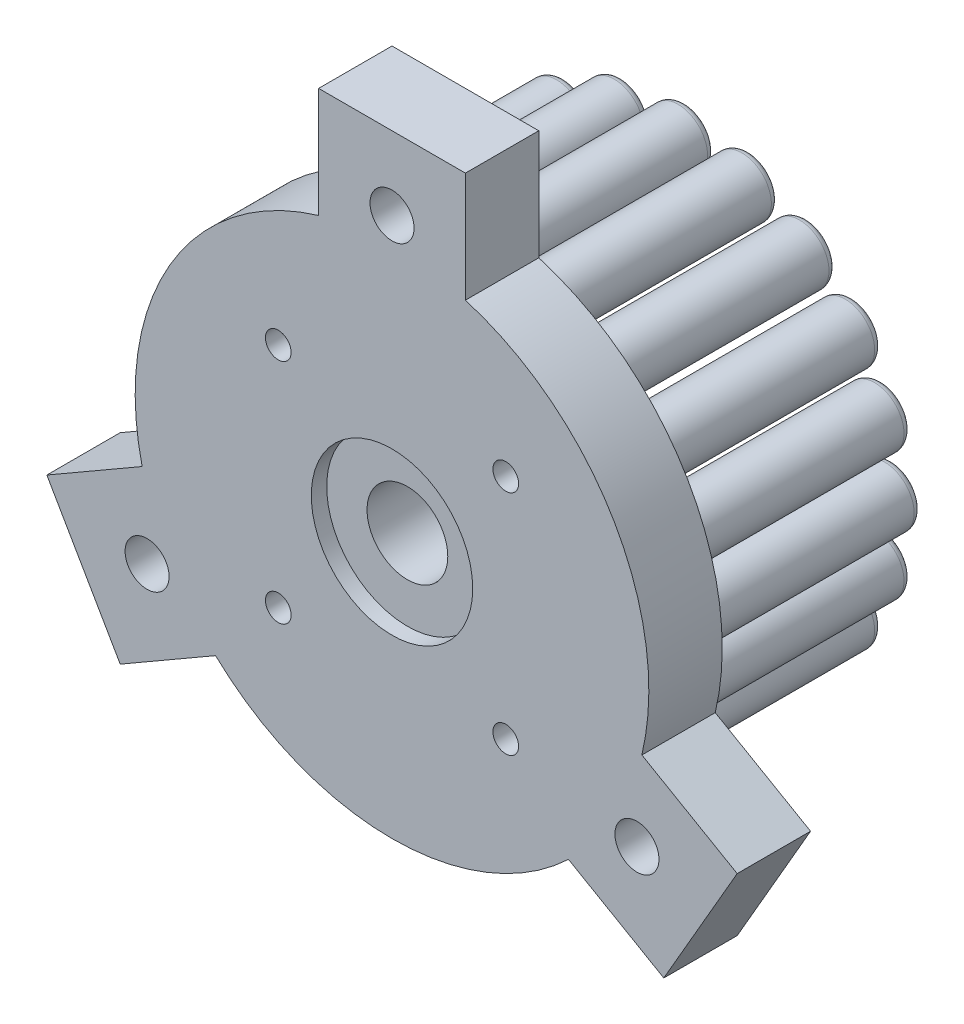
ISO-10303-21;
HEADER;
FILE_DESCRIPTION(('STEP AP214'),'2;1');
FILE_NAME('part.step','',(''),(''),'','','');
FILE_SCHEMA(('AUTOMOTIVE_DESIGN { 1 0 10303 214 1 1 1 1 }'));
ENDSEC;
DATA;
#1=APPLICATION_CONTEXT('core data for automotive mechanical design processes');
#2=APPLICATION_PROTOCOL_DEFINITION('international standard','automotive_design',2000,#1);
#3=PRODUCT_CONTEXT('',#1,'mechanical');
#4=PRODUCT('Part','Part','',(#3));
#5=PRODUCT_RELATED_PRODUCT_CATEGORY('part','',(#4));
#6=PRODUCT_DEFINITION_FORMATION('','',#4);
#7=PRODUCT_DEFINITION_CONTEXT('part definition',#1,'design');
#8=PRODUCT_DEFINITION('design','',#6,#7);
#9=PRODUCT_DEFINITION_SHAPE('','',#8);
#10=(LENGTH_UNIT() NAMED_UNIT(*) SI_UNIT(.MILLI.,.METRE.));
#11=(NAMED_UNIT(*) PLANE_ANGLE_UNIT() SI_UNIT($,.RADIAN.));
#12=(NAMED_UNIT(*) SI_UNIT($,.STERADIAN.) SOLID_ANGLE_UNIT());
#13=UNCERTAINTY_MEASURE_WITH_UNIT(LENGTH_MEASURE(1.E-05),#10,'distance_accuracy_value','');
#14=(GEOMETRIC_REPRESENTATION_CONTEXT(3) GLOBAL_UNCERTAINTY_ASSIGNED_CONTEXT((#13)) GLOBAL_UNIT_ASSIGNED_CONTEXT((#10,
#11,#12)) REPRESENTATION_CONTEXT('',''));
#15=CARTESIAN_POINT('',(0.,0.,0.));
#16=DIRECTION('',(0.,0.,1.));
#17=DIRECTION('',(1.,0.,0.));
#18=AXIS2_PLACEMENT_3D('',#15,#16,#17);
#19=CARTESIAN_POINT('',(0.,0.,30.));
#20=DIRECTION('',(0.,0.,1.));
#21=DIRECTION('',(1.,0.,0.));
#22=AXIS2_PLACEMENT_3D('',#19,#20,#21);
#23=CYLINDRICAL_SURFACE('',#22,5.5);
#24=CARTESIAN_POINT('',(0.,0.,30.));
#25=DIRECTION('',(0.,0.,1.));
#26=DIRECTION('',(1.,0.,0.));
#27=AXIS2_PLACEMENT_3D('',#24,#25,#26);
#28=CIRCLE('',#27,5.5);
#29=CARTESIAN_POINT('',(5.5,0.,30.));
#30=VERTEX_POINT('',#29);
#31=EDGE_CURVE('E302',#30,#30,#28,.T.);
#32=ORIENTED_EDGE('',*,*,#31,.F.);
#33=EDGE_LOOP('',(#32));
#34=FACE_BOUND('',#33,.T.);
#35=CARTESIAN_POINT('',(0.,0.,37.9));
#36=DIRECTION('',(0.,0.,1.));
#37=DIRECTION('',(1.,0.,0.));
#38=AXIS2_PLACEMENT_3D('',#35,#36,#37);
#39=CIRCLE('',#38,5.5);
#40=CARTESIAN_POINT('',(5.5,0.,37.9));
#41=VERTEX_POINT('',#40);
#42=EDGE_CURVE('E118',#41,#41,#39,.F.);
#43=ORIENTED_EDGE('',*,*,#42,.F.);
#44=EDGE_LOOP('',(#43));
#45=FACE_BOUND('',#44,.T.);
#46=ADVANCED_FACE('F114',(#34,#45),#23,.F.);
#47=CARTESIAN_POINT('',(15.5,15.5,30.));
#48=DIRECTION('',(0.,0.,1.));
#49=DIRECTION('',(1.,0.,0.));
#50=AXIS2_PLACEMENT_3D('',#47,#48,#49);
#51=CYLINDRICAL_SURFACE('',#50,1.75);
#52=CARTESIAN_POINT('',(15.5,15.5,40.));
#53=DIRECTION('',(0.,0.,1.));
#54=DIRECTION('',(1.,0.,0.));
#55=AXIS2_PLACEMENT_3D('',#52,#53,#54);
#56=CIRCLE('',#55,1.75);
#57=CARTESIAN_POINT('',(17.25,15.5,40.));
#58=VERTEX_POINT('',#57);
#59=EDGE_CURVE('E592',#58,#58,#56,.T.);
#60=ORIENTED_EDGE('',*,*,#59,.T.);
#61=EDGE_LOOP('',(#60));
#62=FACE_BOUND('',#61,.T.);
#63=CARTESIAN_POINT('',(15.5,15.5,33.));
#64=DIRECTION('',(0.,0.,-1.));
#65=DIRECTION('',(-1.,0.,0.));
#66=AXIS2_PLACEMENT_3D('',#63,#64,#65);
#67=CIRCLE('',#66,1.75);
#68=CARTESIAN_POINT('',(13.75,15.5,33.));
#69=VERTEX_POINT('',#68);
#70=EDGE_CURVE('E574',#69,#69,#67,.F.);
#71=ORIENTED_EDGE('',*,*,#70,.F.);
#72=EDGE_LOOP('',(#71));
#73=FACE_BOUND('',#72,.T.);
#74=ADVANCED_FACE('F688',(#62,#73),#51,.F.);
#75=CARTESIAN_POINT('',(-15.5,15.5,30.));
#76=DIRECTION('',(0.,0.,1.));
#77=DIRECTION('',(1.,0.,0.));
#78=AXIS2_PLACEMENT_3D('',#75,#76,#77);
#79=CYLINDRICAL_SURFACE('',#78,1.75);
#80=CARTESIAN_POINT('',(-15.5,15.5,40.));
#81=DIRECTION('',(0.,0.,1.));
#82=DIRECTION('',(1.,0.,0.));
#83=AXIS2_PLACEMENT_3D('',#80,#81,#82);
#84=CIRCLE('',#83,1.75);
#85=CARTESIAN_POINT('',(-13.75,15.5,40.));
#86=VERTEX_POINT('',#85);
#87=EDGE_CURVE('E588',#86,#86,#84,.T.);
#88=ORIENTED_EDGE('',*,*,#87,.T.);
#89=EDGE_LOOP('',(#88));
#90=FACE_BOUND('',#89,.T.);
#91=CARTESIAN_POINT('',(-15.5,15.5,33.));
#92=DIRECTION('',(0.,0.,-1.));
#93=DIRECTION('',(-1.,0.,0.));
#94=AXIS2_PLACEMENT_3D('',#91,#92,#93);
#95=CIRCLE('',#94,1.75);
#96=CARTESIAN_POINT('',(-17.25,15.5,33.));
#97=VERTEX_POINT('',#96);
#98=EDGE_CURVE('E571',#97,#97,#95,.F.);
#99=ORIENTED_EDGE('',*,*,#98,.F.);
#100=EDGE_LOOP('',(#99));
#101=FACE_BOUND('',#100,.T.);
#102=ADVANCED_FACE('F694',(#90,#101),#79,.F.);
#103=CARTESIAN_POINT('',(-15.5,-15.5,30.));
#104=DIRECTION('',(0.,0.,1.));
#105=DIRECTION('',(1.,0.,0.));
#106=AXIS2_PLACEMENT_3D('',#103,#104,#105);
#107=CYLINDRICAL_SURFACE('',#106,1.75);
#108=CARTESIAN_POINT('',(-15.5,-15.5,40.));
#109=DIRECTION('',(0.,0.,1.));
#110=DIRECTION('',(1.,0.,0.));
#111=AXIS2_PLACEMENT_3D('',#108,#109,#110);
#112=CIRCLE('',#111,1.75);
#113=CARTESIAN_POINT('',(-13.75,-15.5,40.));
#114=VERTEX_POINT('',#113);
#115=EDGE_CURVE('E582',#114,#114,#112,.T.);
#116=ORIENTED_EDGE('',*,*,#115,.T.);
#117=EDGE_LOOP('',(#116));
#118=FACE_BOUND('',#117,.T.);
#119=CARTESIAN_POINT('',(-15.5,-15.5,33.));
#120=DIRECTION('',(0.,0.,-1.));
#121=DIRECTION('',(-1.,0.,0.));
#122=AXIS2_PLACEMENT_3D('',#119,#120,#121);
#123=CIRCLE('',#122,1.75);
#124=CARTESIAN_POINT('',(-17.25,-15.5,33.));
#125=VERTEX_POINT('',#124);
#126=EDGE_CURVE('E566',#125,#125,#123,.F.);
#127=ORIENTED_EDGE('',*,*,#126,.F.);
#128=EDGE_LOOP('',(#127));
#129=FACE_BOUND('',#128,.T.);
#130=ADVANCED_FACE('F1045',(#118,#129),#107,.F.);
#131=CARTESIAN_POINT('',(15.5,-15.5,30.));
#132=DIRECTION('',(0.,0.,1.));
#133=DIRECTION('',(1.,0.,0.));
#134=AXIS2_PLACEMENT_3D('',#131,#132,#133);
#135=CYLINDRICAL_SURFACE('',#134,1.75);
#136=CARTESIAN_POINT('',(15.5,-15.5,40.));
#137=DIRECTION('',(0.,0.,1.));
#138=DIRECTION('',(1.,0.,0.));
#139=AXIS2_PLACEMENT_3D('',#136,#137,#138);
#140=CIRCLE('',#139,1.75);
#141=CARTESIAN_POINT('',(17.25,-15.5,40.));
#142=VERTEX_POINT('',#141);
#143=EDGE_CURVE('E577',#142,#142,#140,.T.);
#144=ORIENTED_EDGE('',*,*,#143,.T.);
#145=EDGE_LOOP('',(#144));
#146=FACE_BOUND('',#145,.T.);
#147=CARTESIAN_POINT('',(15.5,-15.5,33.));
#148=DIRECTION('',(0.,0.,-1.));
#149=DIRECTION('',(-1.,0.,0.));
#150=AXIS2_PLACEMENT_3D('',#147,#148,#149);
#151=CIRCLE('',#150,1.75);
#152=CARTESIAN_POINT('',(13.75,-15.5,33.));
#153=VERTEX_POINT('',#152);
#154=EDGE_CURVE('E562',#153,#153,#151,.F.);
#155=ORIENTED_EDGE('',*,*,#154,.F.);
#156=EDGE_LOOP('',(#155));
#157=FACE_BOUND('',#156,.T.);
#158=ADVANCED_FACE('F1048',(#146,#157),#135,.F.);
#159=CARTESIAN_POINT('',(0.,0.,40.));
#160=DIRECTION('',(0.,0.,-1.));
#161=DIRECTION('',(-1.,0.,0.));
#162=AXIS2_PLACEMENT_3D('',#159,#160,#161);
#163=CYLINDRICAL_SURFACE('',#162,35.);
#164=CARTESIAN_POINT('',(0.,0.,40.));
#165=DIRECTION('',(0.,0.,1.));
#166=DIRECTION('',(1.,0.,0.));
#167=AXIS2_PLACEMENT_3D('',#164,#165,#166);
#168=CIRCLE('',#167,35.);
#169=CARTESIAN_POINT('',(-24.0473750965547,-25.4307638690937,40.));
#170=VERTEX_POINT('',#169);
#171=CARTESIAN_POINT('',(24.0473750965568,-25.4307638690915,40.));
#172=VERTEX_POINT('',#171);
#173=EDGE_CURVE('E321',#170,#172,#168,.T.);
#174=ORIENTED_EDGE('',*,*,#173,.F.);
#175=DIRECTION('',(0.,0.,1.));
#176=VECTOR('',#175,1.);
#177=CARTESIAN_POINT('',(-24.0473750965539,-25.4307638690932,30.));
#178=LINE('',#177,#176);
#179=CARTESIAN_POINT('',(-24.0473750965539,-25.4307638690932,30.));
#180=VERTEX_POINT('',#179);
#181=EDGE_CURVE('E217',#180,#170,#178,.T.);
#182=ORIENTED_EDGE('',*,*,#181,.F.);
#183=CARTESIAN_POINT('',(0.,0.,30.));
#184=DIRECTION('',(0.,0.,1.));
#185=DIRECTION('',(1.,0.,0.));
#186=AXIS2_PLACEMENT_3D('',#183,#184,#185);
#187=CIRCLE('',#186,35.);
#188=CARTESIAN_POINT('',(24.0473750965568,-25.4307638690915,30.));
#189=VERTEX_POINT('',#188);
#190=EDGE_CURVE('E327',#180,#189,#187,.T.);
#191=ORIENTED_EDGE('',*,*,#190,.T.);
#192=DIRECTION('',(0.,0.,1.));
#193=VECTOR('',#192,1.);
#194=CARTESIAN_POINT('',(24.0473750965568,-25.4307638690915,30.));
#195=LINE('',#194,#193);
#196=EDGE_CURVE('E244',#189,#172,#195,.T.);
#197=ORIENTED_EDGE('',*,*,#196,.T.);
#198=EDGE_LOOP('',(#174,#182,#191,#197));
#199=FACE_BOUND('',#198,.T.);
#200=ADVANCED_FACE('F633',(#199),#163,.T.);
#201=CARTESIAN_POINT('',(34.0473750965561,-8.11025579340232,40.));
#202=VERTEX_POINT('',#201);
#203=CARTESIAN_POINT('',(10.,33.5410196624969,40.));
#204=VERTEX_POINT('',#203);
#205=EDGE_CURVE('E322',#202,#204,#168,.T.);
#206=ORIENTED_EDGE('',*,*,#205,.F.);
#207=DIRECTION('',(0.,0.,1.));
#208=VECTOR('',#207,1.);
#209=CARTESIAN_POINT('',(34.0473750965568,-8.11025579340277,30.));
#210=LINE('',#209,#208);
#211=CARTESIAN_POINT('',(34.0473750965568,-8.11025579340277,30.));
#212=VERTEX_POINT('',#211);
#213=EDGE_CURVE('E237',#212,#202,#210,.T.);
#214=ORIENTED_EDGE('',*,*,#213,.F.);
#215=CARTESIAN_POINT('',(10.,33.5410196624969,30.));
#216=VERTEX_POINT('',#215);
#217=EDGE_CURVE('E316',#212,#216,#187,.T.);
#218=ORIENTED_EDGE('',*,*,#217,.T.);
#219=DIRECTION('',(0.,0.,1.));
#220=VECTOR('',#219,1.);
#221=CARTESIAN_POINT('',(10.,33.5410196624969,30.));
#222=LINE('',#221,#220);
#223=EDGE_CURVE('E306',#216,#204,#222,.T.);
#224=ORIENTED_EDGE('',*,*,#223,.T.);
#225=EDGE_LOOP('',(#206,#214,#218,#224));
#226=FACE_BOUND('',#225,.T.);
#227=ADVANCED_FACE('F865',(#226),#163,.T.);
#228=CARTESIAN_POINT('',(26.7722409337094,8.6988283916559,30.));
#229=DIRECTION('',(0.,0.,-1.));
#230=DIRECTION('',(-1.,0.,0.));
#231=AXIS2_PLACEMENT_3D('',#228,#229,#230);
#232=CYLINDRICAL_SURFACE('',#231,4.00000000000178);
#233=CARTESIAN_POINT('',(26.7722409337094,8.6988283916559,1.));
#234=DIRECTION('',(0.,0.,1.));
#235=DIRECTION('',(1.,0.,0.));
#236=AXIS2_PLACEMENT_3D('',#233,#234,#235);
#237=CIRCLE('',#236,4.00000000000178);
#238=CARTESIAN_POINT('',(30.7722409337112,8.6988283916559,1.));
#239=VERTEX_POINT('',#238);
#240=EDGE_CURVE('E407',#239,#239,#237,.T.);
#241=ORIENTED_EDGE('',*,*,#240,.T.);
#242=EDGE_LOOP('',(#241));
#243=FACE_BOUND('',#242,.T.);
#244=CARTESIAN_POINT('',(26.7722409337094,8.6988283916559,30.));
#245=DIRECTION('',(0.,0.,1.));
#246=DIRECTION('',(1.,0.,0.));
#247=AXIS2_PLACEMENT_3D('',#244,#245,#246);
#248=CIRCLE('',#247,4.00000000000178);
#249=CARTESIAN_POINT('',(30.7722409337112,8.6988283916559,30.));
#250=VERTEX_POINT('',#249);
#251=EDGE_CURVE('E320',#250,#250,#248,.T.);
#252=ORIENTED_EDGE('',*,*,#251,.F.);
#253=EDGE_LOOP('',(#252));
#254=FACE_BOUND('',#253,.T.);
#255=ADVANCED_FACE('F868',(#243,#254),#232,.T.);
#256=CARTESIAN_POINT('',(26.7722409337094,8.6988283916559,0.));
#257=DIRECTION('',(0.,0.,1.));
#258=DIRECTION('',(1.,0.,0.));
#259=AXIS2_PLACEMENT_3D('',#256,#257,#258);
#260=PLANE('',#259);
#261=CARTESIAN_POINT('',(26.7722409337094,8.6988283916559,0.));
#262=DIRECTION('',(0.,0.,1.));
#263=DIRECTION('',(1.,0.,0.));
#264=AXIS2_PLACEMENT_3D('',#261,#262,#263);
#265=CIRCLE('',#264,3.00000000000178);
#266=CARTESIAN_POINT('',(29.7722409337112,8.6988283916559,0.));
#267=VERTEX_POINT('',#266);
#268=EDGE_CURVE('E411',#267,#267,#265,.F.);
#269=ORIENTED_EDGE('',*,*,#268,.T.);
#270=EDGE_LOOP('',(#269));
#271=FACE_BOUND('',#270,.T.);
#272=ADVANCED_FACE('F863',(#271),#260,.F.);
#273=CARTESIAN_POINT('',(-10.,33.5410196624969,30.));
#274=VERTEX_POINT('',#273);
#275=CARTESIAN_POINT('',(-34.0473750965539,-8.11025579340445,30.));
#276=VERTEX_POINT('',#275);
#277=EDGE_CURVE('E323',#274,#276,#187,.T.);
#278=ORIENTED_EDGE('',*,*,#277,.T.);
#279=DIRECTION('',(0.,0.,1.));
#280=VECTOR('',#279,1.);
#281=CARTESIAN_POINT('',(-34.0473750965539,-8.11025579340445,30.));
#282=LINE('',#281,#280);
#283=CARTESIAN_POINT('',(-34.0473750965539,-8.11025579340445,40.));
#284=VERTEX_POINT('',#283);
#285=EDGE_CURVE('E241',#276,#284,#282,.T.);
#286=ORIENTED_EDGE('',*,*,#285,.T.);
#287=CARTESIAN_POINT('',(-10.,33.5410196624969,40.));
#288=VERTEX_POINT('',#287);
#289=EDGE_CURVE('E317',#288,#284,#168,.T.);
#290=ORIENTED_EDGE('',*,*,#289,.F.);
#291=DIRECTION('',(0.,0.,1.));
#292=VECTOR('',#291,1.);
#293=CARTESIAN_POINT('',(-10.,33.5410196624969,30.));
#294=LINE('',#293,#292);
#295=EDGE_CURVE('E289',#274,#288,#294,.T.);
#296=ORIENTED_EDGE('',*,*,#295,.F.);
#297=EDGE_LOOP('',(#278,#286,#290,#296));
#298=FACE_BOUND('',#297,.T.);
#299=ADVANCED_FACE('F856',(#298),#163,.T.);
#300=CARTESIAN_POINT('',(0.,0.,40.));
#301=DIRECTION('',(0.,0.,1.));
#302=DIRECTION('',(1.,0.,0.));
#303=AXIS2_PLACEMENT_3D('',#300,#301,#302);
#304=PLANE('',#303);
#305=CARTESIAN_POINT('',(0.,0.,40.));
#306=DIRECTION('',(0.,0.,1.));
#307=DIRECTION('',(1.,0.,0.));
#308=AXIS2_PLACEMENT_3D('',#305,#306,#307);
#309=CIRCLE('',#308,11.);
#310=CARTESIAN_POINT('',(11.,0.,40.));
#311=VERTEX_POINT('',#310);
#312=EDGE_CURVE('E672',#311,#311,#309,.T.);
#313=ORIENTED_EDGE('',*,*,#312,.F.);
#314=EDGE_LOOP('',(#313));
#315=FACE_BOUND('',#314,.T.);
#316=ORIENTED_EDGE('',*,*,#143,.F.);
#317=EDGE_LOOP('',(#316));
#318=FACE_BOUND('',#317,.T.);
#319=ORIENTED_EDGE('',*,*,#115,.F.);
#320=EDGE_LOOP('',(#319));
#321=FACE_BOUND('',#320,.T.);
#322=ORIENTED_EDGE('',*,*,#87,.F.);
#323=EDGE_LOOP('',(#322));
#324=FACE_BOUND('',#323,.T.);
#325=ORIENTED_EDGE('',*,*,#59,.F.);
#326=EDGE_LOOP('',(#325));
#327=FACE_BOUND('',#326,.T.);
#328=CARTESIAN_POINT('',(0.,38.5410196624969,40.));
#329=DIRECTION('',(0.,0.,1.));
#330=DIRECTION('',(1.,0.,0.));
#331=AXIS2_PLACEMENT_3D('',#328,#329,#330);
#332=CIRCLE('',#331,3.);
#333=CARTESIAN_POINT('',(3.,38.5410196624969,40.));
#334=VERTEX_POINT('',#333);
#335=EDGE_CURVE('E597',#334,#334,#332,.T.);
#336=ORIENTED_EDGE('',*,*,#335,.F.);
#337=EDGE_LOOP('',(#336));
#338=FACE_BOUND('',#337,.T.);
#339=CARTESIAN_POINT('',(33.3775021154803,-19.270509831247,40.));
#340=DIRECTION('',(0.,0.,1.));
#341=DIRECTION('',(1.,0.,0.));
#342=AXIS2_PLACEMENT_3D('',#339,#340,#341);
#343=CIRCLE('',#342,3.00000000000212);
#344=CARTESIAN_POINT('',(36.3775021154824,-19.270509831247,40.));
#345=VERTEX_POINT('',#344);
#346=EDGE_CURVE('E602',#345,#345,#343,.T.);
#347=ORIENTED_EDGE('',*,*,#346,.F.);
#348=EDGE_LOOP('',(#347));
#349=FACE_BOUND('',#348,.T.);
#350=CARTESIAN_POINT('',(-33.3775021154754,-19.2705098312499,40.));
#351=DIRECTION('',(0.,0.,1.));
#352=DIRECTION('',(1.,0.,0.));
#353=AXIS2_PLACEMENT_3D('',#350,#351,#352);
#354=CIRCLE('',#353,3.00000000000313);
#355=CARTESIAN_POINT('',(-30.3775021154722,-19.2705098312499,40.));
#356=VERTEX_POINT('',#355);
#357=EDGE_CURVE('E610',#356,#356,#354,.T.);
#358=ORIENTED_EDGE('',*,*,#357,.F.);
#359=EDGE_LOOP('',(#358));
#360=FACE_BOUND('',#359,.T.);
#361=ORIENTED_EDGE('',*,*,#289,.T.);
#362=DIRECTION('',(-0.866025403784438,-0.5,0.));
#363=VECTOR('',#362,1.);
#364=CARTESIAN_POINT('',(-34.0473750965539,-8.11025579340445,40.));
#365=LINE('',#364,#363);
#366=CARTESIAN_POINT('',(-47.0377561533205,-15.6102557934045,40.));
#367=VERTEX_POINT('',#366);
#368=EDGE_CURVE('E221',#284,#367,#365,.T.);
#369=ORIENTED_EDGE('',*,*,#368,.T.);
#370=DIRECTION('',(0.5,-0.866025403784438,0.));
#371=VECTOR('',#370,1.);
#372=CARTESIAN_POINT('',(-37.0377561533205,-32.9307638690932,40.));
#373=LINE('',#372,#371);
#374=CARTESIAN_POINT('',(-37.0377561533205,-32.9307638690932,40.));
#375=VERTEX_POINT('',#374);
#376=EDGE_CURVE('E209',#367,#375,#373,.T.);
#377=ORIENTED_EDGE('',*,*,#376,.T.);
#378=DIRECTION('',(0.866025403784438,0.5,0.));
#379=VECTOR('',#378,1.);
#380=CARTESIAN_POINT('',(-24.0473750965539,-25.4307638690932,40.));
#381=LINE('',#380,#379);
#382=EDGE_CURVE('E132',#375,#170,#381,.T.);
#383=ORIENTED_EDGE('',*,*,#382,.T.);
#384=ORIENTED_EDGE('',*,*,#173,.T.);
#385=DIRECTION('',(0.866025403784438,-0.5,0.));
#386=VECTOR('',#385,1.);
#387=CARTESIAN_POINT('',(24.0473750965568,-25.4307638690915,40.));
#388=LINE('',#387,#386);
#389=CARTESIAN_POINT('',(37.0377561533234,-32.9307638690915,40.));
#390=VERTEX_POINT('',#389);
#391=EDGE_CURVE('E263',#172,#390,#388,.T.);
#392=ORIENTED_EDGE('',*,*,#391,.T.);
#393=DIRECTION('',(0.5,0.866025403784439,0.));
#394=VECTOR('',#393,1.);
#395=CARTESIAN_POINT('',(47.0377561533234,-15.6102557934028,40.));
#396=LINE('',#395,#394);
#397=CARTESIAN_POINT('',(47.0377561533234,-15.6102557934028,40.));
#398=VERTEX_POINT('',#397);
#399=EDGE_CURVE('E259',#390,#398,#396,.T.);
#400=ORIENTED_EDGE('',*,*,#399,.T.);
#401=DIRECTION('',(-0.866025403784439,0.5,0.));
#402=VECTOR('',#401,1.);
#403=CARTESIAN_POINT('',(34.0473750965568,-8.11025579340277,40.));
#404=LINE('',#403,#402);
#405=EDGE_CURVE('E139',#398,#202,#404,.T.);
#406=ORIENTED_EDGE('',*,*,#405,.T.);
#407=ORIENTED_EDGE('',*,*,#205,.T.);
#408=DIRECTION('',(0.,1.,0.));
#409=VECTOR('',#408,1.);
#410=CARTESIAN_POINT('',(10.,33.5410196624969,40.));
#411=LINE('',#410,#409);
#412=CARTESIAN_POINT('',(10.,48.5410196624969,40.));
#413=VERTEX_POINT('',#412);
#414=EDGE_CURVE('E292',#204,#413,#411,.T.);
#415=ORIENTED_EDGE('',*,*,#414,.T.);
#416=DIRECTION('',(-1.,0.,0.));
#417=VECTOR('',#416,1.);
#418=CARTESIAN_POINT('',(-10.,48.5410196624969,40.));
#419=LINE('',#418,#417);
#420=CARTESIAN_POINT('',(-10.,48.5410196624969,40.));
#421=VERTEX_POINT('',#420);
#422=EDGE_CURVE('E281',#413,#421,#419,.T.);
#423=ORIENTED_EDGE('',*,*,#422,.T.);
#424=DIRECTION('',(0.,-1.,0.));
#425=VECTOR('',#424,1.);
#426=CARTESIAN_POINT('',(-10.,33.5410196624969,40.));
#427=LINE('',#426,#425);
#428=EDGE_CURVE('E267',#421,#288,#427,.T.);
#429=ORIENTED_EDGE('',*,*,#428,.T.);
#430=EDGE_LOOP('',(#361,#369,#377,#383,#384,#392,#400,#406,#407,#415,#423,#429));
#431=FACE_BOUND('',#430,.T.);
#432=ADVANCED_FACE('F220',(#315,#318,#321,#324,#327,#338,#349,#360,#431),#304,.T.);
#433=CARTESIAN_POINT('',(0.,0.,30.));
#434=DIRECTION('',(0.,0.,1.));
#435=DIRECTION('',(1.,0.,0.));
#436=AXIS2_PLACEMENT_3D('',#433,#434,#435);
#437=PLANE('',#436);
#438=CARTESIAN_POINT('',(-15.5,15.5,30.));
#439=DIRECTION('',(0.,0.,-1.));
#440=DIRECTION('',(-1.,0.,0.));
#441=AXIS2_PLACEMENT_3D('',#438,#439,#440);
#442=CIRCLE('',#441,3.3);
#443=CARTESIAN_POINT('',(-18.8,15.5,30.));
#444=VERTEX_POINT('',#443);
#445=EDGE_CURVE('E645',#444,#444,#442,.T.);
#446=ORIENTED_EDGE('',*,*,#445,.F.);
#447=EDGE_LOOP('',(#446));
#448=FACE_BOUND('',#447,.T.);
#449=CARTESIAN_POINT('',(15.5,-15.5,30.));
#450=DIRECTION('',(0.,0.,-1.));
#451=DIRECTION('',(-1.,0.,0.));
#452=AXIS2_PLACEMENT_3D('',#449,#450,#451);
#453=CIRCLE('',#452,3.3);
#454=CARTESIAN_POINT('',(12.2,-15.5,30.));
#455=VERTEX_POINT('',#454);
#456=EDGE_CURVE('E653',#455,#455,#453,.T.);
#457=ORIENTED_EDGE('',*,*,#456,.F.);
#458=EDGE_LOOP('',(#457));
#459=FACE_BOUND('',#458,.T.);
#460=CARTESIAN_POINT('',(-15.5,-15.5,30.));
#461=DIRECTION('',(0.,0.,-1.));
#462=DIRECTION('',(-1.,0.,0.));
#463=AXIS2_PLACEMENT_3D('',#460,#461,#462);
#464=CIRCLE('',#463,3.3);
#465=CARTESIAN_POINT('',(-18.8,-15.5,30.));
#466=VERTEX_POINT('',#465);
#467=EDGE_CURVE('E654',#466,#466,#464,.T.);
#468=ORIENTED_EDGE('',*,*,#467,.F.);
#469=EDGE_LOOP('',(#468));
#470=FACE_BOUND('',#469,.T.);
#471=CARTESIAN_POINT('',(15.5,15.5,30.));
#472=DIRECTION('',(0.,0.,-1.));
#473=DIRECTION('',(-1.,0.,0.));
#474=AXIS2_PLACEMENT_3D('',#471,#472,#473);
#475=CIRCLE('',#474,3.3);
#476=CARTESIAN_POINT('',(12.2,15.5,30.));
#477=VERTEX_POINT('',#476);
#478=EDGE_CURVE('E641',#477,#477,#475,.T.);
#479=ORIENTED_EDGE('',*,*,#478,.F.);
#480=EDGE_LOOP('',(#479));
#481=FACE_BOUND('',#480,.T.);
#482=CARTESIAN_POINT('',(0.,38.5410196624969,30.));
#483=DIRECTION('',(0.,0.,1.));
#484=DIRECTION('',(1.,0.,0.));
#485=AXIS2_PLACEMENT_3D('',#482,#483,#484);
#486=CIRCLE('',#485,3.);
#487=CARTESIAN_POINT('',(3.,38.5410196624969,30.));
#488=VERTEX_POINT('',#487);
#489=EDGE_CURVE('E601',#488,#488,#486,.F.);
#490=ORIENTED_EDGE('',*,*,#489,.F.);
#491=EDGE_LOOP('',(#490));
#492=FACE_BOUND('',#491,.T.);
#493=CARTESIAN_POINT('',(33.3775021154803,-19.270509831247,30.));
#494=DIRECTION('',(0.,0.,1.));
#495=DIRECTION('',(1.,0.,0.));
#496=AXIS2_PLACEMENT_3D('',#493,#494,#495);
#497=CIRCLE('',#496,3.00000000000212);
#498=CARTESIAN_POINT('',(36.3775021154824,-19.270509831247,30.));
#499=VERTEX_POINT('',#498);
#500=EDGE_CURVE('E606',#499,#499,#497,.F.);
#501=ORIENTED_EDGE('',*,*,#500,.F.);
#502=EDGE_LOOP('',(#501));
#503=FACE_BOUND('',#502,.T.);
#504=CARTESIAN_POINT('',(-33.3775021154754,-19.2705098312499,30.));
#505=DIRECTION('',(0.,0.,1.));
#506=DIRECTION('',(1.,0.,0.));
#507=AXIS2_PLACEMENT_3D('',#504,#505,#506);
#508=CIRCLE('',#507,3.00000000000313);
#509=CARTESIAN_POINT('',(-30.3775021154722,-19.2705098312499,30.));
#510=VERTEX_POINT('',#509);
#511=EDGE_CURVE('E596',#510,#510,#508,.F.);
#512=ORIENTED_EDGE('',*,*,#511,.F.);
#513=EDGE_LOOP('',(#512));
#514=FACE_BOUND('',#513,.T.);
#515=ORIENTED_EDGE('',*,*,#31,.T.);
#516=EDGE_LOOP('',(#515));
#517=FACE_BOUND('',#516,.T.);
#518=CARTESIAN_POINT('',(-8.69882839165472,26.7722409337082,30.));
#519=DIRECTION('',(0.,0.,1.));
#520=DIRECTION('',(1.,0.,0.));
#521=AXIS2_PLACEMENT_3D('',#518,#519,#520);
#522=CIRCLE('',#521,4.00000000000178);
#523=CARTESIAN_POINT('',(-4.69882839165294,26.7722409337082,30.));
#524=VERTEX_POINT('',#523);
#525=EDGE_CURVE('E403',#524,#524,#522,.F.);
#526=ORIENTED_EDGE('',*,*,#525,.F.);
#527=EDGE_LOOP('',(#526));
#528=FACE_BOUND('',#527,.T.);
#529=CARTESIAN_POINT('',(-16.5461548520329,22.7738283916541,30.));
#530=DIRECTION('',(0.,0.,1.));
#531=DIRECTION('',(1.,0.,0.));
#532=AXIS2_PLACEMENT_3D('',#529,#530,#531);
#533=CIRCLE('',#532,4.00000000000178);
#534=CARTESIAN_POINT('',(-12.5461548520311,22.7738283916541,30.));
#535=VERTEX_POINT('',#534);
#536=EDGE_CURVE('E399',#535,#535,#533,.F.);
#537=ORIENTED_EDGE('',*,*,#536,.F.);
#538=EDGE_LOOP('',(#537));
#539=FACE_BOUND('',#538,.T.);
#540=CARTESIAN_POINT('',(-22.7738283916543,16.5461548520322,30.));
#541=DIRECTION('',(0.,0.,1.));
#542=DIRECTION('',(1.,0.,0.));
#543=AXIS2_PLACEMENT_3D('',#540,#541,#542);
#544=CIRCLE('',#543,4.00000000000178);
#545=CARTESIAN_POINT('',(-18.7738283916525,16.5461548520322,30.));
#546=VERTEX_POINT('',#545);
#547=EDGE_CURVE('E395',#546,#546,#544,.F.);
#548=ORIENTED_EDGE('',*,*,#547,.F.);
#549=EDGE_LOOP('',(#548));
#550=FACE_BOUND('',#549,.T.);
#551=CARTESIAN_POINT('',(-26.7722409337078,8.69882839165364,30.));
#552=DIRECTION('',(0.,0.,1.));
#553=DIRECTION('',(1.,0.,0.));
#554=AXIS2_PLACEMENT_3D('',#551,#552,#553);
#555=CIRCLE('',#554,4.00000000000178);
#556=CARTESIAN_POINT('',(-22.772240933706,8.69882839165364,30.));
#557=VERTEX_POINT('',#556);
#558=EDGE_CURVE('E391',#557,#557,#555,.F.);
#559=ORIENTED_EDGE('',*,*,#558,.F.);
#560=EDGE_LOOP('',(#559));
#561=FACE_BOUND('',#560,.T.);
#562=CARTESIAN_POINT('',(-28.1499999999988,-1.19202484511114E-12,30.));
#563=DIRECTION('',(0.,0.,1.));
#564=DIRECTION('',(1.,0.,0.));
#565=AXIS2_PLACEMENT_3D('',#562,#563,#564);
#566=CIRCLE('',#565,4.00000000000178);
#567=CARTESIAN_POINT('',(-24.149999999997,-1.19202484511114E-12,30.));
#568=VERTEX_POINT('',#567);
#569=EDGE_CURVE('E387',#568,#568,#566,.F.);
#570=ORIENTED_EDGE('',*,*,#569,.F.);
#571=EDGE_LOOP('',(#570));
#572=FACE_BOUND('',#571,.T.);
#573=CARTESIAN_POINT('',(-26.772240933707,-8.6988283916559,30.));
#574=DIRECTION('',(0.,0.,1.));
#575=DIRECTION('',(1.,0.,0.));
#576=AXIS2_PLACEMENT_3D('',#573,#574,#575);
#577=CIRCLE('',#576,4.00000000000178);
#578=CARTESIAN_POINT('',(-22.7722409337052,-8.6988283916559,30.));
#579=VERTEX_POINT('',#578);
#580=EDGE_CURVE('E383',#579,#579,#577,.F.);
#581=ORIENTED_EDGE('',*,*,#580,.F.);
#582=EDGE_LOOP('',(#581));
#583=FACE_BOUND('',#582,.T.);
#584=CARTESIAN_POINT('',(-22.7738283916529,-16.5461548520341,30.));
#585=DIRECTION('',(0.,0.,1.));
#586=DIRECTION('',(1.,0.,0.));
#587=AXIS2_PLACEMENT_3D('',#584,#585,#586);
#588=CIRCLE('',#587,4.00000000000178);
#589=CARTESIAN_POINT('',(-18.7738283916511,-16.5461548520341,30.));
#590=VERTEX_POINT('',#589);
#591=EDGE_CURVE('E379',#590,#590,#588,.F.);
#592=ORIENTED_EDGE('',*,*,#591,.F.);
#593=EDGE_LOOP('',(#592));
#594=FACE_BOUND('',#593,.T.);
#595=CARTESIAN_POINT('',(28.1500000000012,1.18857746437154E-12,30.));
#596=DIRECTION('',(0.,0.,1.));
#597=DIRECTION('',(1.,0.,0.));
#598=AXIS2_PLACEMENT_3D('',#595,#596,#597);
#599=CIRCLE('',#598,4.00000000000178);
#600=CARTESIAN_POINT('',(32.150000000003,1.18857746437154E-12,30.));
#601=VERTEX_POINT('',#600);
#602=EDGE_CURVE('E375',#601,#601,#599,.F.);
#603=ORIENTED_EDGE('',*,*,#602,.F.);
#604=EDGE_LOOP('',(#603));
#605=FACE_BOUND('',#604,.T.);
#606=CARTESIAN_POINT('',(26.7722409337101,-8.69882839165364,30.));
#607=DIRECTION('',(0.,0.,1.));
#608=DIRECTION('',(1.,0.,0.));
#609=AXIS2_PLACEMENT_3D('',#606,#607,#608);
#610=CIRCLE('',#609,4.00000000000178);
#611=CARTESIAN_POINT('',(30.7722409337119,-8.69882839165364,30.));
#612=VERTEX_POINT('',#611);
#613=EDGE_CURVE('E371',#612,#612,#610,.F.);
#614=ORIENTED_EDGE('',*,*,#613,.F.);
#615=EDGE_LOOP('',(#614));
#616=FACE_BOUND('',#615,.T.);
#617=CARTESIAN_POINT('',(22.7738283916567,-16.5461548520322,30.));
#618=DIRECTION('',(0.,0.,1.));
#619=DIRECTION('',(1.,0.,0.));
#620=AXIS2_PLACEMENT_3D('',#617,#618,#619);
#621=CIRCLE('',#620,4.00000000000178);
#622=CARTESIAN_POINT('',(26.7738283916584,-16.5461548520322,30.));
#623=VERTEX_POINT('',#622);
#624=EDGE_CURVE('E367',#623,#623,#621,.F.);
#625=ORIENTED_EDGE('',*,*,#624,.F.);
#626=EDGE_LOOP('',(#625));
#627=FACE_BOUND('',#626,.T.);
#628=CARTESIAN_POINT('',(16.5461548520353,-22.7738283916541,30.));
#629=DIRECTION('',(0.,0.,1.));
#630=DIRECTION('',(1.,0.,0.));
#631=AXIS2_PLACEMENT_3D('',#628,#629,#630);
#632=CIRCLE('',#631,4.00000000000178);
#633=CARTESIAN_POINT('',(20.546154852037,-22.7738283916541,30.));
#634=VERTEX_POINT('',#633);
#635=EDGE_CURVE('E363',#634,#634,#632,.F.);
#636=ORIENTED_EDGE('',*,*,#635,.F.);
#637=EDGE_LOOP('',(#636));
#638=FACE_BOUND('',#637,.T.);
#639=CARTESIAN_POINT('',(8.69882839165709,-26.7722409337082,30.));
#640=DIRECTION('',(0.,0.,1.));
#641=DIRECTION('',(1.,0.,0.));
#642=AXIS2_PLACEMENT_3D('',#639,#640,#641);
#643=CIRCLE('',#642,4.00000000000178);
#644=CARTESIAN_POINT('',(12.6988283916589,-26.7722409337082,30.));
#645=VERTEX_POINT('',#644);
#646=EDGE_CURVE('E359',#645,#645,#643,.F.);
#647=ORIENTED_EDGE('',*,*,#646,.F.);
#648=EDGE_LOOP('',(#647));
#649=FACE_BOUND('',#648,.T.);
#650=CARTESIAN_POINT('',(2.37715492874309E-12,-28.15,30.));
#651=DIRECTION('',(0.,0.,1.));
#652=DIRECTION('',(1.,0.,0.));
#653=AXIS2_PLACEMENT_3D('',#650,#651,#652);
#654=CIRCLE('',#653,4.00000000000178);
#655=CARTESIAN_POINT('',(4.00000000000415,-28.15,30.));
#656=VERTEX_POINT('',#655);
#657=EDGE_CURVE('E355',#656,#656,#654,.F.);
#658=ORIENTED_EDGE('',*,*,#657,.F.);
#659=EDGE_LOOP('',(#658));
#660=FACE_BOUND('',#659,.T.);
#661=CARTESIAN_POINT('',(-8.69882839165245,-26.7722409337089,30.));
#662=DIRECTION('',(0.,0.,1.));
#663=DIRECTION('',(1.,0.,0.));
#664=AXIS2_PLACEMENT_3D('',#661,#662,#663);
#665=CIRCLE('',#664,4.00000000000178);
#666=CARTESIAN_POINT('',(-4.69882839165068,-26.7722409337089,30.));
#667=VERTEX_POINT('',#666);
#668=EDGE_CURVE('E351',#667,#667,#665,.F.);
#669=ORIENTED_EDGE('',*,*,#668,.F.);
#670=EDGE_LOOP('',(#669));
#671=FACE_BOUND('',#670,.T.);
#672=CARTESIAN_POINT('',(-16.546154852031,-22.7738283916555,30.));
#673=DIRECTION('',(0.,0.,1.));
#674=DIRECTION('',(1.,0.,0.));
#675=AXIS2_PLACEMENT_3D('',#672,#673,#674);
#676=CIRCLE('',#675,4.00000000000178);
#677=CARTESIAN_POINT('',(-12.5461548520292,-22.7738283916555,30.));
#678=VERTEX_POINT('',#677);
#679=EDGE_CURVE('E347',#678,#678,#676,.F.);
#680=ORIENTED_EDGE('',*,*,#679,.F.);
#681=EDGE_LOOP('',(#680));
#682=FACE_BOUND('',#681,.T.);
#683=CARTESIAN_POINT('',(0.,28.15,30.));
#684=DIRECTION('',(0.,0.,1.));
#685=DIRECTION('',(1.,0.,0.));
#686=AXIS2_PLACEMENT_3D('',#683,#684,#685);
#687=CIRCLE('',#686,4.00000000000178);
#688=CARTESIAN_POINT('',(4.00000000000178,28.15,30.));
#689=VERTEX_POINT('',#688);
#690=EDGE_CURVE('E343',#689,#689,#687,.F.);
#691=ORIENTED_EDGE('',*,*,#690,.F.);
#692=EDGE_LOOP('',(#691));
#693=FACE_BOUND('',#692,.T.);
#694=CARTESIAN_POINT('',(8.69882839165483,26.7722409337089,30.));
#695=DIRECTION('',(0.,0.,1.));
#696=DIRECTION('',(1.,0.,0.));
#697=AXIS2_PLACEMENT_3D('',#694,#695,#696);
#698=CIRCLE('',#697,4.00000000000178);
#699=CARTESIAN_POINT('',(12.6988283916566,26.7722409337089,30.));
#700=VERTEX_POINT('',#699);
#701=EDGE_CURVE('E339',#700,#700,#698,.F.);
#702=ORIENTED_EDGE('',*,*,#701,.F.);
#703=EDGE_LOOP('',(#702));
#704=FACE_BOUND('',#703,.T.);
#705=CARTESIAN_POINT('',(16.5461548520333,22.7738283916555,30.));
#706=DIRECTION('',(0.,0.,1.));
#707=DIRECTION('',(1.,0.,0.));
#708=AXIS2_PLACEMENT_3D('',#705,#706,#707);
#709=CIRCLE('',#708,4.00000000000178);
#710=CARTESIAN_POINT('',(20.5461548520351,22.7738283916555,30.));
#711=VERTEX_POINT('',#710);
#712=EDGE_CURVE('E335',#711,#711,#709,.F.);
#713=ORIENTED_EDGE('',*,*,#712,.F.);
#714=EDGE_LOOP('',(#713));
#715=FACE_BOUND('',#714,.T.);
#716=CARTESIAN_POINT('',(22.7738283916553,16.5461548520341,30.));
#717=DIRECTION('',(0.,0.,1.));
#718=DIRECTION('',(1.,0.,0.));
#719=AXIS2_PLACEMENT_3D('',#716,#717,#718);
#720=CIRCLE('',#719,4.00000000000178);
#721=CARTESIAN_POINT('',(26.773828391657,16.5461548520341,30.));
#722=VERTEX_POINT('',#721);
#723=EDGE_CURVE('E331',#722,#722,#720,.F.);
#724=ORIENTED_EDGE('',*,*,#723,.F.);
#725=EDGE_LOOP('',(#724));
#726=FACE_BOUND('',#725,.T.);
#727=ORIENTED_EDGE('',*,*,#251,.T.);
#728=EDGE_LOOP('',(#727));
#729=FACE_BOUND('',#728,.T.);
#730=ORIENTED_EDGE('',*,*,#190,.F.);
#731=DIRECTION('',(0.866025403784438,0.5,0.));
#732=VECTOR('',#731,1.);
#733=CARTESIAN_POINT('',(-24.0473750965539,-25.4307638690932,30.));
#734=LINE('',#733,#732);
#735=CARTESIAN_POINT('',(-37.0377561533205,-32.9307638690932,30.));
#736=VERTEX_POINT('',#735);
#737=EDGE_CURVE('E238',#736,#180,#734,.T.);
#738=ORIENTED_EDGE('',*,*,#737,.F.);
#739=DIRECTION('',(0.5,-0.866025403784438,0.));
#740=VECTOR('',#739,1.);
#741=CARTESIAN_POINT('',(-37.0377561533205,-32.9307638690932,30.));
#742=LINE('',#741,#740);
#743=CARTESIAN_POINT('',(-47.0377561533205,-15.6102557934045,30.));
#744=VERTEX_POINT('',#743);
#745=EDGE_CURVE('E212',#744,#736,#742,.T.);
#746=ORIENTED_EDGE('',*,*,#745,.F.);
#747=DIRECTION('',(-0.866025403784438,-0.5,0.));
#748=VECTOR('',#747,1.);
#749=CARTESIAN_POINT('',(-34.0473750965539,-8.11025579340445,30.));
#750=LINE('',#749,#748);
#751=EDGE_CURVE('E228',#276,#744,#750,.T.);
#752=ORIENTED_EDGE('',*,*,#751,.F.);
#753=ORIENTED_EDGE('',*,*,#277,.F.);
#754=DIRECTION('',(0.,-1.,0.));
#755=VECTOR('',#754,1.);
#756=CARTESIAN_POINT('',(-10.,33.5410196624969,30.));
#757=LINE('',#756,#755);
#758=CARTESIAN_POINT('',(-10.,48.5410196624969,30.));
#759=VERTEX_POINT('',#758);
#760=EDGE_CURVE('E277',#759,#274,#757,.T.);
#761=ORIENTED_EDGE('',*,*,#760,.F.);
#762=DIRECTION('',(-1.,0.,0.));
#763=VECTOR('',#762,1.);
#764=CARTESIAN_POINT('',(-10.,48.5410196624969,30.));
#765=LINE('',#764,#763);
#766=CARTESIAN_POINT('',(10.,48.5410196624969,30.));
#767=VERTEX_POINT('',#766);
#768=EDGE_CURVE('E285',#767,#759,#765,.T.);
#769=ORIENTED_EDGE('',*,*,#768,.F.);
#770=DIRECTION('',(0.,1.,0.));
#771=VECTOR('',#770,1.);
#772=CARTESIAN_POINT('',(10.,33.5410196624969,30.));
#773=LINE('',#772,#771);
#774=EDGE_CURVE('E280',#216,#767,#773,.T.);
#775=ORIENTED_EDGE('',*,*,#774,.F.);
#776=ORIENTED_EDGE('',*,*,#217,.F.);
#777=DIRECTION('',(-0.866025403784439,0.5,0.));
#778=VECTOR('',#777,1.);
#779=CARTESIAN_POINT('',(34.0473750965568,-8.11025579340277,30.));
#780=LINE('',#779,#778);
#781=CARTESIAN_POINT('',(47.0377561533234,-15.6102557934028,30.));
#782=VERTEX_POINT('',#781);
#783=EDGE_CURVE('E248',#782,#212,#780,.T.);
#784=ORIENTED_EDGE('',*,*,#783,.F.);
#785=DIRECTION('',(0.5,0.866025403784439,0.));
#786=VECTOR('',#785,1.);
#787=CARTESIAN_POINT('',(47.0377561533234,-15.6102557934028,30.));
#788=LINE('',#787,#786);
#789=CARTESIAN_POINT('',(37.0377561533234,-32.9307638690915,30.));
#790=VERTEX_POINT('',#789);
#791=EDGE_CURVE('E270',#790,#782,#788,.T.);
#792=ORIENTED_EDGE('',*,*,#791,.F.);
#793=DIRECTION('',(0.866025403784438,-0.5,0.));
#794=VECTOR('',#793,1.);
#795=CARTESIAN_POINT('',(24.0473750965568,-25.4307638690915,30.));
#796=LINE('',#795,#794);
#797=EDGE_CURVE('E260',#189,#790,#796,.T.);
#798=ORIENTED_EDGE('',*,*,#797,.F.);
#799=EDGE_LOOP('',(#730,#738,#746,#752,#753,#761,#769,#775,#776,#784,#792,#798));
#800=FACE_BOUND('',#799,.T.);
#801=ADVANCED_FACE('F629',(#448,#459,#470,#481,#492,#503,#514,#517,#528,#539,#550,#561,#572,
#583,#594,#605,#616,#627,#638,#649,#660,#671,#682,#693,#704,#715,#726,#729,#800),#437,.F.);
#802=CARTESIAN_POINT('',(22.7738283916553,16.5461548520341,30.));
#803=DIRECTION('',(0.,0.,-1.));
#804=DIRECTION('',(-1.,0.,0.));
#805=AXIS2_PLACEMENT_3D('',#802,#803,#804);
#806=CYLINDRICAL_SURFACE('',#805,4.00000000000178);
#807=CARTESIAN_POINT('',(22.7738283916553,16.5461548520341,1.));
#808=DIRECTION('',(0.,0.,1.));
#809=DIRECTION('',(1.,0.,0.));
#810=AXIS2_PLACEMENT_3D('',#807,#808,#809);
#811=CIRCLE('',#810,4.00000000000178);
#812=CARTESIAN_POINT('',(26.773828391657,16.5461548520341,1.));
#813=VERTEX_POINT('',#812);
#814=EDGE_CURVE('E479',#813,#813,#811,.T.);
#815=ORIENTED_EDGE('',*,*,#814,.T.);
#816=EDGE_LOOP('',(#815));
#817=FACE_BOUND('',#816,.T.);
#818=ORIENTED_EDGE('',*,*,#723,.T.);
#819=EDGE_LOOP('',(#818));
#820=FACE_BOUND('',#819,.T.);
#821=ADVANCED_FACE('F847',(#817,#820),#806,.T.);
#822=CARTESIAN_POINT('',(22.7738283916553,16.5461548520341,0.));
#823=DIRECTION('',(0.,0.,1.));
#824=DIRECTION('',(1.,0.,0.));
#825=AXIS2_PLACEMENT_3D('',#822,#823,#824);
#826=PLANE('',#825);
#827=CARTESIAN_POINT('',(22.7738283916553,16.5461548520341,0.));
#828=DIRECTION('',(0.,0.,1.));
#829=DIRECTION('',(1.,0.,0.));
#830=AXIS2_PLACEMENT_3D('',#827,#828,#829);
#831=CIRCLE('',#830,3.00000000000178);
#832=CARTESIAN_POINT('',(25.773828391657,16.5461548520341,0.));
#833=VERTEX_POINT('',#832);
#834=EDGE_CURVE('E483',#833,#833,#831,.F.);
#835=ORIENTED_EDGE('',*,*,#834,.T.);
#836=EDGE_LOOP('',(#835));
#837=FACE_BOUND('',#836,.T.);
#838=ADVANCED_FACE('F842',(#837),#826,.F.);
#839=CARTESIAN_POINT('',(16.5461548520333,22.7738283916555,30.));
#840=DIRECTION('',(0.,0.,-1.));
#841=DIRECTION('',(-1.,0.,0.));
#842=AXIS2_PLACEMENT_3D('',#839,#840,#841);
#843=CYLINDRICAL_SURFACE('',#842,4.00000000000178);
#844=CARTESIAN_POINT('',(16.5461548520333,22.7738283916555,1.));
#845=DIRECTION('',(0.,0.,1.));
#846=DIRECTION('',(1.,0.,0.));
#847=AXIS2_PLACEMENT_3D('',#844,#845,#846);
#848=CIRCLE('',#847,4.00000000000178);
#849=CARTESIAN_POINT('',(20.5461548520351,22.7738283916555,1.));
#850=VERTEX_POINT('',#849);
#851=EDGE_CURVE('E487',#850,#850,#848,.T.);
#852=ORIENTED_EDGE('',*,*,#851,.T.);
#853=EDGE_LOOP('',(#852));
#854=FACE_BOUND('',#853,.T.);
#855=ORIENTED_EDGE('',*,*,#712,.T.);
#856=EDGE_LOOP('',(#855));
#857=FACE_BOUND('',#856,.T.);
#858=ADVANCED_FACE('F839',(#854,#857),#843,.T.);
#859=CARTESIAN_POINT('',(16.5461548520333,22.7738283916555,0.));
#860=DIRECTION('',(0.,0.,1.));
#861=DIRECTION('',(1.,0.,0.));
#862=AXIS2_PLACEMENT_3D('',#859,#860,#861);
#863=PLANE('',#862);
#864=CARTESIAN_POINT('',(16.5461548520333,22.7738283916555,0.));
#865=DIRECTION('',(0.,0.,1.));
#866=DIRECTION('',(1.,0.,0.));
#867=AXIS2_PLACEMENT_3D('',#864,#865,#866);
#868=CIRCLE('',#867,3.00000000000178);
#869=CARTESIAN_POINT('',(19.5461548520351,22.7738283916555,0.));
#870=VERTEX_POINT('',#869);
#871=EDGE_CURVE('E491',#870,#870,#868,.F.);
#872=ORIENTED_EDGE('',*,*,#871,.T.);
#873=EDGE_LOOP('',(#872));
#874=FACE_BOUND('',#873,.T.);
#875=ADVANCED_FACE('F834',(#874),#863,.F.);
#876=CARTESIAN_POINT('',(8.69882839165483,26.7722409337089,30.));
#877=DIRECTION('',(0.,0.,-1.));
#878=DIRECTION('',(-1.,0.,0.));
#879=AXIS2_PLACEMENT_3D('',#876,#877,#878);
#880=CYLINDRICAL_SURFACE('',#879,4.00000000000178);
#881=CARTESIAN_POINT('',(8.69882839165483,26.7722409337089,1.));
#882=DIRECTION('',(0.,0.,1.));
#883=DIRECTION('',(1.,0.,0.));
#884=AXIS2_PLACEMENT_3D('',#881,#882,#883);
#885=CIRCLE('',#884,4.00000000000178);
#886=CARTESIAN_POINT('',(12.6988283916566,26.7722409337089,1.));
#887=VERTEX_POINT('',#886);
#888=EDGE_CURVE('E495',#887,#887,#885,.T.);
#889=ORIENTED_EDGE('',*,*,#888,.T.);
#890=EDGE_LOOP('',(#889));
#891=FACE_BOUND('',#890,.T.);
#892=ORIENTED_EDGE('',*,*,#701,.T.);
#893=EDGE_LOOP('',(#892));
#894=FACE_BOUND('',#893,.T.);
#895=ADVANCED_FACE('F831',(#891,#894),#880,.T.);
#896=CARTESIAN_POINT('',(8.69882839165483,26.7722409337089,0.));
#897=DIRECTION('',(0.,0.,1.));
#898=DIRECTION('',(1.,0.,0.));
#899=AXIS2_PLACEMENT_3D('',#896,#897,#898);
#900=PLANE('',#899);
#901=CARTESIAN_POINT('',(8.69882839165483,26.7722409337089,0.));
#902=DIRECTION('',(0.,0.,1.));
#903=DIRECTION('',(1.,0.,0.));
#904=AXIS2_PLACEMENT_3D('',#901,#902,#903);
#905=CIRCLE('',#904,3.00000000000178);
#906=CARTESIAN_POINT('',(11.6988283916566,26.7722409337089,0.));
#907=VERTEX_POINT('',#906);
#908=EDGE_CURVE('E499',#907,#907,#905,.F.);
#909=ORIENTED_EDGE('',*,*,#908,.T.);
#910=EDGE_LOOP('',(#909));
#911=FACE_BOUND('',#910,.T.);
#912=ADVANCED_FACE('F826',(#911),#900,.F.);
#913=CARTESIAN_POINT('',(0.,28.15,30.));
#914=DIRECTION('',(0.,0.,-1.));
#915=DIRECTION('',(-1.,0.,0.));
#916=AXIS2_PLACEMENT_3D('',#913,#914,#915);
#917=CYLINDRICAL_SURFACE('',#916,4.00000000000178);
#918=CARTESIAN_POINT('',(0.,28.15,1.));
#919=DIRECTION('',(0.,0.,1.));
#920=DIRECTION('',(1.,0.,0.));
#921=AXIS2_PLACEMENT_3D('',#918,#919,#920);
#922=CIRCLE('',#921,4.00000000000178);
#923=CARTESIAN_POINT('',(4.00000000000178,28.15,1.));
#924=VERTEX_POINT('',#923);
#925=EDGE_CURVE('E124',#924,#924,#922,.T.);
#926=ORIENTED_EDGE('',*,*,#925,.T.);
#927=EDGE_LOOP('',(#926));
#928=FACE_BOUND('',#927,.T.);
#929=ORIENTED_EDGE('',*,*,#690,.T.);
#930=EDGE_LOOP('',(#929));
#931=FACE_BOUND('',#930,.T.);
#932=ADVANCED_FACE('F823',(#928,#931),#917,.T.);
#933=CARTESIAN_POINT('',(0.,28.15,0.));
#934=DIRECTION('',(0.,0.,1.));
#935=DIRECTION('',(1.,0.,0.));
#936=AXIS2_PLACEMENT_3D('',#933,#934,#935);
#937=PLANE('',#936);
#938=CARTESIAN_POINT('',(0.,28.15,0.));
#939=DIRECTION('',(0.,0.,1.));
#940=DIRECTION('',(1.,0.,0.));
#941=AXIS2_PLACEMENT_3D('',#938,#939,#940);
#942=CIRCLE('',#941,3.00000000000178);
#943=CARTESIAN_POINT('',(3.00000000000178,28.15,0.));
#944=VERTEX_POINT('',#943);
#945=EDGE_CURVE('E12',#944,#944,#942,.F.);
#946=ORIENTED_EDGE('',*,*,#945,.T.);
#947=EDGE_LOOP('',(#946));
#948=FACE_BOUND('',#947,.T.);
#949=ADVANCED_FACE('F818',(#948),#937,.F.);
#950=CARTESIAN_POINT('',(-16.546154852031,-22.7738283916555,30.));
#951=DIRECTION('',(0.,0.,-1.));
#952=DIRECTION('',(-1.,0.,0.));
#953=AXIS2_PLACEMENT_3D('',#950,#951,#952);
#954=CYLINDRICAL_SURFACE('',#953,4.00000000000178);
#955=CARTESIAN_POINT('',(-16.546154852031,-22.7738283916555,1.));
#956=DIRECTION('',(0.,0.,1.));
#957=DIRECTION('',(1.,0.,0.));
#958=AXIS2_PLACEMENT_3D('',#955,#956,#957);
#959=CIRCLE('',#958,4.00000000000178);
#960=CARTESIAN_POINT('',(-12.5461548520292,-22.7738283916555,1.));
#961=VERTEX_POINT('',#960);
#962=EDGE_CURVE('E415',#961,#961,#959,.T.);
#963=ORIENTED_EDGE('',*,*,#962,.T.);
#964=EDGE_LOOP('',(#963));
#965=FACE_BOUND('',#964,.T.);
#966=ORIENTED_EDGE('',*,*,#679,.T.);
#967=EDGE_LOOP('',(#966));
#968=FACE_BOUND('',#967,.T.);
#969=ADVANCED_FACE('F815',(#965,#968),#954,.T.);
#970=CARTESIAN_POINT('',(-16.546154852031,-22.7738283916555,0.));
#971=DIRECTION('',(0.,0.,1.));
#972=DIRECTION('',(1.,0.,0.));
#973=AXIS2_PLACEMENT_3D('',#970,#971,#972);
#974=PLANE('',#973);
#975=CARTESIAN_POINT('',(-16.546154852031,-22.7738283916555,0.));
#976=DIRECTION('',(0.,0.,1.));
#977=DIRECTION('',(1.,0.,0.));
#978=AXIS2_PLACEMENT_3D('',#975,#976,#977);
#979=CIRCLE('',#978,3.00000000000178);
#980=CARTESIAN_POINT('',(-13.5461548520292,-22.7738283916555,0.));
#981=VERTEX_POINT('',#980);
#982=EDGE_CURVE('E419',#981,#981,#979,.F.);
#983=ORIENTED_EDGE('',*,*,#982,.T.);
#984=EDGE_LOOP('',(#983));
#985=FACE_BOUND('',#984,.T.);
#986=ADVANCED_FACE('F810',(#985),#974,.F.);
#987=CARTESIAN_POINT('',(-8.69882839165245,-26.7722409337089,30.));
#988=DIRECTION('',(0.,0.,-1.));
#989=DIRECTION('',(-1.,0.,0.));
#990=AXIS2_PLACEMENT_3D('',#987,#988,#989);
#991=CYLINDRICAL_SURFACE('',#990,4.00000000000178);
#992=CARTESIAN_POINT('',(-8.69882839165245,-26.7722409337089,1.));
#993=DIRECTION('',(0.,0.,1.));
#994=DIRECTION('',(1.,0.,0.));
#995=AXIS2_PLACEMENT_3D('',#992,#993,#994);
#996=CIRCLE('',#995,4.00000000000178);
#997=CARTESIAN_POINT('',(-4.69882839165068,-26.7722409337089,1.));
#998=VERTEX_POINT('',#997);
#999=EDGE_CURVE('E423',#998,#998,#996,.T.);
#1000=ORIENTED_EDGE('',*,*,#999,.T.);
#1001=EDGE_LOOP('',(#1000));
#1002=FACE_BOUND('',#1001,.T.);
#1003=ORIENTED_EDGE('',*,*,#668,.T.);
#1004=EDGE_LOOP('',(#1003));
#1005=FACE_BOUND('',#1004,.T.);
#1006=ADVANCED_FACE('F807',(#1002,#1005),#991,.T.);
#1007=CARTESIAN_POINT('',(-8.69882839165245,-26.7722409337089,0.));
#1008=DIRECTION('',(0.,0.,1.));
#1009=DIRECTION('',(1.,0.,0.));
#1010=AXIS2_PLACEMENT_3D('',#1007,#1008,#1009);
#1011=PLANE('',#1010);
#1012=CARTESIAN_POINT('',(-8.69882839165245,-26.7722409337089,0.));
#1013=DIRECTION('',(0.,0.,1.));
#1014=DIRECTION('',(1.,0.,0.));
#1015=AXIS2_PLACEMENT_3D('',#1012,#1013,#1014);
#1016=CIRCLE('',#1015,3.00000000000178);
#1017=CARTESIAN_POINT('',(-5.69882839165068,-26.7722409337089,0.));
#1018=VERTEX_POINT('',#1017);
#1019=EDGE_CURVE('E427',#1018,#1018,#1016,.F.);
#1020=ORIENTED_EDGE('',*,*,#1019,.T.);
#1021=EDGE_LOOP('',(#1020));
#1022=FACE_BOUND('',#1021,.T.);
#1023=ADVANCED_FACE('F802',(#1022),#1011,.F.);
#1024=CARTESIAN_POINT('',(2.37715492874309E-12,-28.15,30.));
#1025=DIRECTION('',(0.,0.,-1.));
#1026=DIRECTION('',(-1.,0.,0.));
#1027=AXIS2_PLACEMENT_3D('',#1024,#1025,#1026);
#1028=CYLINDRICAL_SURFACE('',#1027,4.00000000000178);
#1029=CARTESIAN_POINT('',(2.37715492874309E-12,-28.15,1.));
#1030=DIRECTION('',(0.,0.,1.));
#1031=DIRECTION('',(1.,0.,0.));
#1032=AXIS2_PLACEMENT_3D('',#1029,#1030,#1031);
#1033=CIRCLE('',#1032,4.00000000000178);
#1034=CARTESIAN_POINT('',(4.00000000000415,-28.15,1.));
#1035=VERTEX_POINT('',#1034);
#1036=EDGE_CURVE('E431',#1035,#1035,#1033,.T.);
#1037=ORIENTED_EDGE('',*,*,#1036,.T.);
#1038=EDGE_LOOP('',(#1037));
#1039=FACE_BOUND('',#1038,.T.);
#1040=ORIENTED_EDGE('',*,*,#657,.T.);
#1041=EDGE_LOOP('',(#1040));
#1042=FACE_BOUND('',#1041,.T.);
#1043=ADVANCED_FACE('F799',(#1039,#1042),#1028,.T.);
#1044=CARTESIAN_POINT('',(2.37715492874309E-12,-28.15,0.));
#1045=DIRECTION('',(0.,0.,1.));
#1046=DIRECTION('',(1.,0.,0.));
#1047=AXIS2_PLACEMENT_3D('',#1044,#1045,#1046);
#1048=PLANE('',#1047);
#1049=CARTESIAN_POINT('',(2.37715492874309E-12,-28.15,0.));
#1050=DIRECTION('',(0.,0.,1.));
#1051=DIRECTION('',(1.,0.,0.));
#1052=AXIS2_PLACEMENT_3D('',#1049,#1050,#1051);
#1053=CIRCLE('',#1052,3.00000000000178);
#1054=CARTESIAN_POINT('',(3.00000000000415,-28.15,0.));
#1055=VERTEX_POINT('',#1054);
#1056=EDGE_CURVE('E435',#1055,#1055,#1053,.F.);
#1057=ORIENTED_EDGE('',*,*,#1056,.T.);
#1058=EDGE_LOOP('',(#1057));
#1059=FACE_BOUND('',#1058,.T.);
#1060=ADVANCED_FACE('F794',(#1059),#1048,.F.);
#1061=CARTESIAN_POINT('',(8.69882839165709,-26.7722409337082,30.));
#1062=DIRECTION('',(0.,0.,-1.));
#1063=DIRECTION('',(-1.,0.,0.));
#1064=AXIS2_PLACEMENT_3D('',#1061,#1062,#1063);
#1065=CYLINDRICAL_SURFACE('',#1064,4.00000000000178);
#1066=CARTESIAN_POINT('',(8.69882839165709,-26.7722409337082,1.));
#1067=DIRECTION('',(0.,0.,1.));
#1068=DIRECTION('',(1.,0.,0.));
#1069=AXIS2_PLACEMENT_3D('',#1066,#1067,#1068);
#1070=CIRCLE('',#1069,4.00000000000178);
#1071=CARTESIAN_POINT('',(12.6988283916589,-26.7722409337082,1.));
#1072=VERTEX_POINT('',#1071);
#1073=EDGE_CURVE('E439',#1072,#1072,#1070,.T.);
#1074=ORIENTED_EDGE('',*,*,#1073,.T.);
#1075=EDGE_LOOP('',(#1074));
#1076=FACE_BOUND('',#1075,.T.);
#1077=ORIENTED_EDGE('',*,*,#646,.T.);
#1078=EDGE_LOOP('',(#1077));
#1079=FACE_BOUND('',#1078,.T.);
#1080=ADVANCED_FACE('F791',(#1076,#1079),#1065,.T.);
#1081=CARTESIAN_POINT('',(8.69882839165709,-26.7722409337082,0.));
#1082=DIRECTION('',(0.,0.,1.));
#1083=DIRECTION('',(1.,0.,0.));
#1084=AXIS2_PLACEMENT_3D('',#1081,#1082,#1083);
#1085=PLANE('',#1084);
#1086=CARTESIAN_POINT('',(8.69882839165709,-26.7722409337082,0.));
#1087=DIRECTION('',(0.,0.,1.));
#1088=DIRECTION('',(1.,0.,0.));
#1089=AXIS2_PLACEMENT_3D('',#1086,#1087,#1088);
#1090=CIRCLE('',#1089,3.00000000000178);
#1091=CARTESIAN_POINT('',(11.6988283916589,-26.7722409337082,0.));
#1092=VERTEX_POINT('',#1091);
#1093=EDGE_CURVE('E443',#1092,#1092,#1090,.F.);
#1094=ORIENTED_EDGE('',*,*,#1093,.T.);
#1095=EDGE_LOOP('',(#1094));
#1096=FACE_BOUND('',#1095,.T.);
#1097=ADVANCED_FACE('F786',(#1096),#1085,.F.);
#1098=CARTESIAN_POINT('',(16.5461548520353,-22.7738283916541,30.));
#1099=DIRECTION('',(0.,0.,-1.));
#1100=DIRECTION('',(-1.,0.,0.));
#1101=AXIS2_PLACEMENT_3D('',#1098,#1099,#1100);
#1102=CYLINDRICAL_SURFACE('',#1101,4.00000000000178);
#1103=CARTESIAN_POINT('',(16.5461548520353,-22.7738283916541,1.));
#1104=DIRECTION('',(0.,0.,1.));
#1105=DIRECTION('',(1.,0.,0.));
#1106=AXIS2_PLACEMENT_3D('',#1103,#1104,#1105);
#1107=CIRCLE('',#1106,4.00000000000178);
#1108=CARTESIAN_POINT('',(20.546154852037,-22.7738283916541,1.));
#1109=VERTEX_POINT('',#1108);
#1110=EDGE_CURVE('E447',#1109,#1109,#1107,.T.);
#1111=ORIENTED_EDGE('',*,*,#1110,.T.);
#1112=EDGE_LOOP('',(#1111));
#1113=FACE_BOUND('',#1112,.T.);
#1114=ORIENTED_EDGE('',*,*,#635,.T.);
#1115=EDGE_LOOP('',(#1114));
#1116=FACE_BOUND('',#1115,.T.);
#1117=ADVANCED_FACE('F783',(#1113,#1116),#1102,.T.);
#1118=CARTESIAN_POINT('',(16.5461548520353,-22.7738283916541,0.));
#1119=DIRECTION('',(0.,0.,1.));
#1120=DIRECTION('',(1.,0.,0.));
#1121=AXIS2_PLACEMENT_3D('',#1118,#1119,#1120);
#1122=PLANE('',#1121);
#1123=CARTESIAN_POINT('',(16.5461548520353,-22.7738283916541,0.));
#1124=DIRECTION('',(0.,0.,1.));
#1125=DIRECTION('',(1.,0.,0.));
#1126=AXIS2_PLACEMENT_3D('',#1123,#1124,#1125);
#1127=CIRCLE('',#1126,3.00000000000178);
#1128=CARTESIAN_POINT('',(19.546154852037,-22.7738283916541,0.));
#1129=VERTEX_POINT('',#1128);
#1130=EDGE_CURVE('E451',#1129,#1129,#1127,.F.);
#1131=ORIENTED_EDGE('',*,*,#1130,.T.);
#1132=EDGE_LOOP('',(#1131));
#1133=FACE_BOUND('',#1132,.T.);
#1134=ADVANCED_FACE('F778',(#1133),#1122,.F.);
#1135=CARTESIAN_POINT('',(22.7738283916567,-16.5461548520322,30.));
#1136=DIRECTION('',(0.,0.,-1.));
#1137=DIRECTION('',(-1.,0.,0.));
#1138=AXIS2_PLACEMENT_3D('',#1135,#1136,#1137);
#1139=CYLINDRICAL_SURFACE('',#1138,4.00000000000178);
#1140=CARTESIAN_POINT('',(22.7738283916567,-16.5461548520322,1.));
#1141=DIRECTION('',(0.,0.,1.));
#1142=DIRECTION('',(1.,0.,0.));
#1143=AXIS2_PLACEMENT_3D('',#1140,#1141,#1142);
#1144=CIRCLE('',#1143,4.00000000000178);
#1145=CARTESIAN_POINT('',(26.7738283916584,-16.5461548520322,1.));
#1146=VERTEX_POINT('',#1145);
#1147=EDGE_CURVE('E455',#1146,#1146,#1144,.T.);
#1148=ORIENTED_EDGE('',*,*,#1147,.T.);
#1149=EDGE_LOOP('',(#1148));
#1150=FACE_BOUND('',#1149,.T.);
#1151=ORIENTED_EDGE('',*,*,#624,.T.);
#1152=EDGE_LOOP('',(#1151));
#1153=FACE_BOUND('',#1152,.T.);
#1154=ADVANCED_FACE('F775',(#1150,#1153),#1139,.T.);
#1155=CARTESIAN_POINT('',(22.7738283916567,-16.5461548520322,0.));
#1156=DIRECTION('',(0.,0.,1.));
#1157=DIRECTION('',(1.,0.,0.));
#1158=AXIS2_PLACEMENT_3D('',#1155,#1156,#1157);
#1159=PLANE('',#1158);
#1160=CARTESIAN_POINT('',(22.7738283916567,-16.5461548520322,0.));
#1161=DIRECTION('',(0.,0.,1.));
#1162=DIRECTION('',(1.,0.,0.));
#1163=AXIS2_PLACEMENT_3D('',#1160,#1161,#1162);
#1164=CIRCLE('',#1163,3.00000000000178);
#1165=CARTESIAN_POINT('',(25.7738283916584,-16.5461548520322,0.));
#1166=VERTEX_POINT('',#1165);
#1167=EDGE_CURVE('E459',#1166,#1166,#1164,.F.);
#1168=ORIENTED_EDGE('',*,*,#1167,.T.);
#1169=EDGE_LOOP('',(#1168));
#1170=FACE_BOUND('',#1169,.T.);
#1171=ADVANCED_FACE('F770',(#1170),#1159,.F.);
#1172=CARTESIAN_POINT('',(26.7722409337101,-8.69882839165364,30.));
#1173=DIRECTION('',(0.,0.,-1.));
#1174=DIRECTION('',(-1.,0.,0.));
#1175=AXIS2_PLACEMENT_3D('',#1172,#1173,#1174);
#1176=CYLINDRICAL_SURFACE('',#1175,4.00000000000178);
#1177=CARTESIAN_POINT('',(26.7722409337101,-8.69882839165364,1.));
#1178=DIRECTION('',(0.,0.,1.));
#1179=DIRECTION('',(1.,0.,0.));
#1180=AXIS2_PLACEMENT_3D('',#1177,#1178,#1179);
#1181=CIRCLE('',#1180,4.00000000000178);
#1182=CARTESIAN_POINT('',(30.7722409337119,-8.69882839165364,1.));
#1183=VERTEX_POINT('',#1182);
#1184=EDGE_CURVE('E463',#1183,#1183,#1181,.T.);
#1185=ORIENTED_EDGE('',*,*,#1184,.T.);
#1186=EDGE_LOOP('',(#1185));
#1187=FACE_BOUND('',#1186,.T.);
#1188=ORIENTED_EDGE('',*,*,#613,.T.);
#1189=EDGE_LOOP('',(#1188));
#1190=FACE_BOUND('',#1189,.T.);
#1191=ADVANCED_FACE('F767',(#1187,#1190),#1176,.T.);
#1192=CARTESIAN_POINT('',(26.7722409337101,-8.69882839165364,0.));
#1193=DIRECTION('',(0.,0.,1.));
#1194=DIRECTION('',(1.,0.,0.));
#1195=AXIS2_PLACEMENT_3D('',#1192,#1193,#1194);
#1196=PLANE('',#1195);
#1197=CARTESIAN_POINT('',(26.7722409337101,-8.69882839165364,0.));
#1198=DIRECTION('',(0.,0.,1.));
#1199=DIRECTION('',(1.,0.,0.));
#1200=AXIS2_PLACEMENT_3D('',#1197,#1198,#1199);
#1201=CIRCLE('',#1200,3.00000000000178);
#1202=CARTESIAN_POINT('',(29.7722409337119,-8.69882839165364,0.));
#1203=VERTEX_POINT('',#1202);
#1204=EDGE_CURVE('E467',#1203,#1203,#1201,.F.);
#1205=ORIENTED_EDGE('',*,*,#1204,.T.);
#1206=EDGE_LOOP('',(#1205));
#1207=FACE_BOUND('',#1206,.T.);
#1208=ADVANCED_FACE('F762',(#1207),#1196,.F.);
#1209=CARTESIAN_POINT('',(28.1500000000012,1.18857746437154E-12,30.));
#1210=DIRECTION('',(0.,0.,-1.));
#1211=DIRECTION('',(-1.,0.,0.));
#1212=AXIS2_PLACEMENT_3D('',#1209,#1210,#1211);
#1213=CYLINDRICAL_SURFACE('',#1212,4.00000000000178);
#1214=CARTESIAN_POINT('',(28.1500000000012,1.18857746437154E-12,1.));
#1215=DIRECTION('',(0.,0.,1.));
#1216=DIRECTION('',(1.,0.,0.));
#1217=AXIS2_PLACEMENT_3D('',#1214,#1215,#1216);
#1218=CIRCLE('',#1217,4.00000000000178);
#1219=CARTESIAN_POINT('',(32.150000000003,1.18857746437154E-12,1.));
#1220=VERTEX_POINT('',#1219);
#1221=EDGE_CURVE('E471',#1220,#1220,#1218,.T.);
#1222=ORIENTED_EDGE('',*,*,#1221,.T.);
#1223=EDGE_LOOP('',(#1222));
#1224=FACE_BOUND('',#1223,.T.);
#1225=ORIENTED_EDGE('',*,*,#602,.T.);
#1226=EDGE_LOOP('',(#1225));
#1227=FACE_BOUND('',#1226,.T.);
#1228=ADVANCED_FACE('F759',(#1224,#1227),#1213,.T.);
#1229=CARTESIAN_POINT('',(28.1500000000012,1.18857746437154E-12,0.));
#1230=DIRECTION('',(0.,0.,1.));
#1231=DIRECTION('',(1.,0.,0.));
#1232=AXIS2_PLACEMENT_3D('',#1229,#1230,#1231);
#1233=PLANE('',#1232);
#1234=CARTESIAN_POINT('',(28.1500000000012,1.18857746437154E-12,0.));
#1235=DIRECTION('',(0.,0.,1.));
#1236=DIRECTION('',(1.,0.,0.));
#1237=AXIS2_PLACEMENT_3D('',#1234,#1235,#1236);
#1238=CIRCLE('',#1237,3.00000000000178);
#1239=CARTESIAN_POINT('',(31.150000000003,1.18857746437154E-12,0.));
#1240=VERTEX_POINT('',#1239);
#1241=EDGE_CURVE('E475',#1240,#1240,#1238,.F.);
#1242=ORIENTED_EDGE('',*,*,#1241,.T.);
#1243=EDGE_LOOP('',(#1242));
#1244=FACE_BOUND('',#1243,.T.);
#1245=ADVANCED_FACE('F754',(#1244),#1233,.F.);
#1246=CARTESIAN_POINT('',(-22.7738283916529,-16.5461548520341,30.));
#1247=DIRECTION('',(0.,0.,-1.));
#1248=DIRECTION('',(-1.,0.,0.));
#1249=AXIS2_PLACEMENT_3D('',#1246,#1247,#1248);
#1250=CYLINDRICAL_SURFACE('',#1249,4.00000000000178);
#1251=CARTESIAN_POINT('',(-22.7738283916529,-16.5461548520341,1.));
#1252=DIRECTION('',(0.,0.,1.));
#1253=DIRECTION('',(1.,0.,0.));
#1254=AXIS2_PLACEMENT_3D('',#1251,#1252,#1253);
#1255=CIRCLE('',#1254,4.00000000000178);
#1256=CARTESIAN_POINT('',(-18.7738283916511,-16.5461548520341,1.));
#1257=VERTEX_POINT('',#1256);
#1258=EDGE_CURVE('E503',#1257,#1257,#1255,.T.);
#1259=ORIENTED_EDGE('',*,*,#1258,.T.);
#1260=EDGE_LOOP('',(#1259));
#1261=FACE_BOUND('',#1260,.T.);
#1262=ORIENTED_EDGE('',*,*,#591,.T.);
#1263=EDGE_LOOP('',(#1262));
#1264=FACE_BOUND('',#1263,.T.);
#1265=ADVANCED_FACE('F751',(#1261,#1264),#1250,.T.);
#1266=CARTESIAN_POINT('',(-22.7738283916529,-16.5461548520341,0.));
#1267=DIRECTION('',(0.,0.,1.));
#1268=DIRECTION('',(1.,0.,0.));
#1269=AXIS2_PLACEMENT_3D('',#1266,#1267,#1268);
#1270=PLANE('',#1269);
#1271=CARTESIAN_POINT('',(-22.7738283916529,-16.5461548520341,0.));
#1272=DIRECTION('',(0.,0.,1.));
#1273=DIRECTION('',(1.,0.,0.));
#1274=AXIS2_PLACEMENT_3D('',#1271,#1272,#1273);
#1275=CIRCLE('',#1274,3.00000000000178);
#1276=CARTESIAN_POINT('',(-19.7738283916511,-16.5461548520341,0.));
#1277=VERTEX_POINT('',#1276);
#1278=EDGE_CURVE('E507',#1277,#1277,#1275,.F.);
#1279=ORIENTED_EDGE('',*,*,#1278,.T.);
#1280=EDGE_LOOP('',(#1279));
#1281=FACE_BOUND('',#1280,.T.);
#1282=ADVANCED_FACE('F746',(#1281),#1270,.F.);
#1283=CARTESIAN_POINT('',(-26.772240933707,-8.6988283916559,30.));
#1284=DIRECTION('',(0.,0.,-1.));
#1285=DIRECTION('',(-1.,0.,0.));
#1286=AXIS2_PLACEMENT_3D('',#1283,#1284,#1285);
#1287=CYLINDRICAL_SURFACE('',#1286,4.00000000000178);
#1288=CARTESIAN_POINT('',(-26.772240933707,-8.6988283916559,1.));
#1289=DIRECTION('',(0.,0.,1.));
#1290=DIRECTION('',(1.,0.,0.));
#1291=AXIS2_PLACEMENT_3D('',#1288,#1289,#1290);
#1292=CIRCLE('',#1291,4.00000000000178);
#1293=CARTESIAN_POINT('',(-22.7722409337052,-8.6988283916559,1.));
#1294=VERTEX_POINT('',#1293);
#1295=EDGE_CURVE('E511',#1294,#1294,#1292,.T.);
#1296=ORIENTED_EDGE('',*,*,#1295,.T.);
#1297=EDGE_LOOP('',(#1296));
#1298=FACE_BOUND('',#1297,.T.);
#1299=ORIENTED_EDGE('',*,*,#580,.T.);
#1300=EDGE_LOOP('',(#1299));
#1301=FACE_BOUND('',#1300,.T.);
#1302=ADVANCED_FACE('F743',(#1298,#1301),#1287,.T.);
#1303=CARTESIAN_POINT('',(-26.772240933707,-8.6988283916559,0.));
#1304=DIRECTION('',(0.,0.,1.));
#1305=DIRECTION('',(1.,0.,0.));
#1306=AXIS2_PLACEMENT_3D('',#1303,#1304,#1305);
#1307=PLANE('',#1306);
#1308=CARTESIAN_POINT('',(-26.772240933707,-8.6988283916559,0.));
#1309=DIRECTION('',(0.,0.,1.));
#1310=DIRECTION('',(1.,0.,0.));
#1311=AXIS2_PLACEMENT_3D('',#1308,#1309,#1310);
#1312=CIRCLE('',#1311,3.00000000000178);
#1313=CARTESIAN_POINT('',(-23.7722409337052,-8.6988283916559,0.));
#1314=VERTEX_POINT('',#1313);
#1315=EDGE_CURVE('E515',#1314,#1314,#1312,.F.);
#1316=ORIENTED_EDGE('',*,*,#1315,.T.);
#1317=EDGE_LOOP('',(#1316));
#1318=FACE_BOUND('',#1317,.T.);
#1319=ADVANCED_FACE('F738',(#1318),#1307,.F.);
#1320=CARTESIAN_POINT('',(-28.1499999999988,-1.19202484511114E-12,30.));
#1321=DIRECTION('',(0.,0.,-1.));
#1322=DIRECTION('',(-1.,0.,0.));
#1323=AXIS2_PLACEMENT_3D('',#1320,#1321,#1322);
#1324=CYLINDRICAL_SURFACE('',#1323,4.00000000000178);
#1325=CARTESIAN_POINT('',(-28.1499999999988,-1.19202484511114E-12,1.));
#1326=DIRECTION('',(0.,0.,1.));
#1327=DIRECTION('',(1.,0.,0.));
#1328=AXIS2_PLACEMENT_3D('',#1325,#1326,#1327);
#1329=CIRCLE('',#1328,4.00000000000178);
#1330=CARTESIAN_POINT('',(-24.149999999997,-1.19202484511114E-12,1.));
#1331=VERTEX_POINT('',#1330);
#1332=EDGE_CURVE('E519',#1331,#1331,#1329,.T.);
#1333=ORIENTED_EDGE('',*,*,#1332,.T.);
#1334=EDGE_LOOP('',(#1333));
#1335=FACE_BOUND('',#1334,.T.);
#1336=ORIENTED_EDGE('',*,*,#569,.T.);
#1337=EDGE_LOOP('',(#1336));
#1338=FACE_BOUND('',#1337,.T.);
#1339=ADVANCED_FACE('F735',(#1335,#1338),#1324,.T.);
#1340=CARTESIAN_POINT('',(-28.1499999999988,-1.19202484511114E-12,0.));
#1341=DIRECTION('',(0.,0.,1.));
#1342=DIRECTION('',(1.,0.,0.));
#1343=AXIS2_PLACEMENT_3D('',#1340,#1341,#1342);
#1344=PLANE('',#1343);
#1345=CARTESIAN_POINT('',(-28.1499999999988,-1.19202484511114E-12,0.));
#1346=DIRECTION('',(0.,0.,1.));
#1347=DIRECTION('',(1.,0.,0.));
#1348=AXIS2_PLACEMENT_3D('',#1345,#1346,#1347);
#1349=CIRCLE('',#1348,3.00000000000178);
#1350=CARTESIAN_POINT('',(-25.149999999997,-1.19202484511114E-12,0.));
#1351=VERTEX_POINT('',#1350);
#1352=EDGE_CURVE('E523',#1351,#1351,#1349,.F.);
#1353=ORIENTED_EDGE('',*,*,#1352,.T.);
#1354=EDGE_LOOP('',(#1353));
#1355=FACE_BOUND('',#1354,.T.);
#1356=ADVANCED_FACE('F730',(#1355),#1344,.F.);
#1357=CARTESIAN_POINT('',(-26.7722409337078,8.69882839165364,30.));
#1358=DIRECTION('',(0.,0.,-1.));
#1359=DIRECTION('',(-1.,0.,0.));
#1360=AXIS2_PLACEMENT_3D('',#1357,#1358,#1359);
#1361=CYLINDRICAL_SURFACE('',#1360,4.00000000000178);
#1362=CARTESIAN_POINT('',(-26.7722409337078,8.69882839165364,1.));
#1363=DIRECTION('',(0.,0.,1.));
#1364=DIRECTION('',(1.,0.,0.));
#1365=AXIS2_PLACEMENT_3D('',#1362,#1363,#1364);
#1366=CIRCLE('',#1365,4.00000000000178);
#1367=CARTESIAN_POINT('',(-22.772240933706,8.69882839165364,1.));
#1368=VERTEX_POINT('',#1367);
#1369=EDGE_CURVE('E527',#1368,#1368,#1366,.T.);
#1370=ORIENTED_EDGE('',*,*,#1369,.T.);
#1371=EDGE_LOOP('',(#1370));
#1372=FACE_BOUND('',#1371,.T.);
#1373=ORIENTED_EDGE('',*,*,#558,.T.);
#1374=EDGE_LOOP('',(#1373));
#1375=FACE_BOUND('',#1374,.T.);
#1376=ADVANCED_FACE('F727',(#1372,#1375),#1361,.T.);
#1377=CARTESIAN_POINT('',(-26.7722409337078,8.69882839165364,0.));
#1378=DIRECTION('',(0.,0.,1.));
#1379=DIRECTION('',(1.,0.,0.));
#1380=AXIS2_PLACEMENT_3D('',#1377,#1378,#1379);
#1381=PLANE('',#1380);
#1382=CARTESIAN_POINT('',(-26.7722409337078,8.69882839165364,0.));
#1383=DIRECTION('',(0.,0.,1.));
#1384=DIRECTION('',(1.,0.,0.));
#1385=AXIS2_PLACEMENT_3D('',#1382,#1383,#1384);
#1386=CIRCLE('',#1385,3.00000000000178);
#1387=CARTESIAN_POINT('',(-23.772240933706,8.69882839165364,0.));
#1388=VERTEX_POINT('',#1387);
#1389=EDGE_CURVE('E531',#1388,#1388,#1386,.F.);
#1390=ORIENTED_EDGE('',*,*,#1389,.T.);
#1391=EDGE_LOOP('',(#1390));
#1392=FACE_BOUND('',#1391,.T.);
#1393=ADVANCED_FACE('F722',(#1392),#1381,.F.);
#1394=CARTESIAN_POINT('',(-22.7738283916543,16.5461548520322,30.));
#1395=DIRECTION('',(0.,0.,-1.));
#1396=DIRECTION('',(-1.,0.,0.));
#1397=AXIS2_PLACEMENT_3D('',#1394,#1395,#1396);
#1398=CYLINDRICAL_SURFACE('',#1397,4.00000000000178);
#1399=CARTESIAN_POINT('',(-22.7738283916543,16.5461548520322,1.));
#1400=DIRECTION('',(0.,0.,1.));
#1401=DIRECTION('',(1.,0.,0.));
#1402=AXIS2_PLACEMENT_3D('',#1399,#1400,#1401);
#1403=CIRCLE('',#1402,4.00000000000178);
#1404=CARTESIAN_POINT('',(-18.7738283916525,16.5461548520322,1.));
#1405=VERTEX_POINT('',#1404);
#1406=EDGE_CURVE('E535',#1405,#1405,#1403,.T.);
#1407=ORIENTED_EDGE('',*,*,#1406,.T.);
#1408=EDGE_LOOP('',(#1407));
#1409=FACE_BOUND('',#1408,.T.);
#1410=ORIENTED_EDGE('',*,*,#547,.T.);
#1411=EDGE_LOOP('',(#1410));
#1412=FACE_BOUND('',#1411,.T.);
#1413=ADVANCED_FACE('F719',(#1409,#1412),#1398,.T.);
#1414=CARTESIAN_POINT('',(-22.7738283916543,16.5461548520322,0.));
#1415=DIRECTION('',(0.,0.,1.));
#1416=DIRECTION('',(1.,0.,0.));
#1417=AXIS2_PLACEMENT_3D('',#1414,#1415,#1416);
#1418=PLANE('',#1417);
#1419=CARTESIAN_POINT('',(-22.7738283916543,16.5461548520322,0.));
#1420=DIRECTION('',(0.,0.,1.));
#1421=DIRECTION('',(1.,0.,0.));
#1422=AXIS2_PLACEMENT_3D('',#1419,#1420,#1421);
#1423=CIRCLE('',#1422,3.00000000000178);
#1424=CARTESIAN_POINT('',(-19.7738283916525,16.5461548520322,0.));
#1425=VERTEX_POINT('',#1424);
#1426=EDGE_CURVE('E539',#1425,#1425,#1423,.F.);
#1427=ORIENTED_EDGE('',*,*,#1426,.T.);
#1428=EDGE_LOOP('',(#1427));
#1429=FACE_BOUND('',#1428,.T.);
#1430=ADVANCED_FACE('F714',(#1429),#1418,.F.);
#1431=CARTESIAN_POINT('',(-16.5461548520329,22.7738283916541,30.));
#1432=DIRECTION('',(0.,0.,-1.));
#1433=DIRECTION('',(-1.,0.,0.));
#1434=AXIS2_PLACEMENT_3D('',#1431,#1432,#1433);
#1435=CYLINDRICAL_SURFACE('',#1434,4.00000000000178);
#1436=CARTESIAN_POINT('',(-16.5461548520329,22.7738283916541,1.));
#1437=DIRECTION('',(0.,0.,1.));
#1438=DIRECTION('',(1.,0.,0.));
#1439=AXIS2_PLACEMENT_3D('',#1436,#1437,#1438);
#1440=CIRCLE('',#1439,4.00000000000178);
#1441=CARTESIAN_POINT('',(-12.5461548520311,22.7738283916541,1.));
#1442=VERTEX_POINT('',#1441);
#1443=EDGE_CURVE('E543',#1442,#1442,#1440,.T.);
#1444=ORIENTED_EDGE('',*,*,#1443,.T.);
#1445=EDGE_LOOP('',(#1444));
#1446=FACE_BOUND('',#1445,.T.);
#1447=ORIENTED_EDGE('',*,*,#536,.T.);
#1448=EDGE_LOOP('',(#1447));
#1449=FACE_BOUND('',#1448,.T.);
#1450=ADVANCED_FACE('F711',(#1446,#1449),#1435,.T.);
#1451=CARTESIAN_POINT('',(-16.5461548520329,22.7738283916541,0.));
#1452=DIRECTION('',(0.,0.,1.));
#1453=DIRECTION('',(1.,0.,0.));
#1454=AXIS2_PLACEMENT_3D('',#1451,#1452,#1453);
#1455=PLANE('',#1454);
#1456=CARTESIAN_POINT('',(-16.5461548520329,22.7738283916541,0.));
#1457=DIRECTION('',(0.,0.,1.));
#1458=DIRECTION('',(1.,0.,0.));
#1459=AXIS2_PLACEMENT_3D('',#1456,#1457,#1458);
#1460=CIRCLE('',#1459,3.00000000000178);
#1461=CARTESIAN_POINT('',(-13.5461548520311,22.7738283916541,0.));
#1462=VERTEX_POINT('',#1461);
#1463=EDGE_CURVE('E547',#1462,#1462,#1460,.F.);
#1464=ORIENTED_EDGE('',*,*,#1463,.T.);
#1465=EDGE_LOOP('',(#1464));
#1466=FACE_BOUND('',#1465,.T.);
#1467=ADVANCED_FACE('F706',(#1466),#1455,.F.);
#1468=CARTESIAN_POINT('',(-8.69882839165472,26.7722409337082,30.));
#1469=DIRECTION('',(0.,0.,-1.));
#1470=DIRECTION('',(-1.,0.,0.));
#1471=AXIS2_PLACEMENT_3D('',#1468,#1469,#1470);
#1472=CYLINDRICAL_SURFACE('',#1471,4.00000000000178);
#1473=CARTESIAN_POINT('',(-8.69882839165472,26.7722409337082,1.));
#1474=DIRECTION('',(0.,0.,1.));
#1475=DIRECTION('',(1.,0.,0.));
#1476=AXIS2_PLACEMENT_3D('',#1473,#1474,#1475);
#1477=CIRCLE('',#1476,4.00000000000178);
#1478=CARTESIAN_POINT('',(-4.69882839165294,26.7722409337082,1.));
#1479=VERTEX_POINT('',#1478);
#1480=EDGE_CURVE('E551',#1479,#1479,#1477,.T.);
#1481=ORIENTED_EDGE('',*,*,#1480,.T.);
#1482=EDGE_LOOP('',(#1481));
#1483=FACE_BOUND('',#1482,.T.);
#1484=ORIENTED_EDGE('',*,*,#525,.T.);
#1485=EDGE_LOOP('',(#1484));
#1486=FACE_BOUND('',#1485,.T.);
#1487=ADVANCED_FACE('F702',(#1483,#1486),#1472,.T.);
#1488=CARTESIAN_POINT('',(-8.69882839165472,26.7722409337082,0.));
#1489=DIRECTION('',(0.,0.,1.));
#1490=DIRECTION('',(1.,0.,0.));
#1491=AXIS2_PLACEMENT_3D('',#1488,#1489,#1490);
#1492=PLANE('',#1491);
#1493=CARTESIAN_POINT('',(-8.69882839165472,26.7722409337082,0.));
#1494=DIRECTION('',(0.,0.,1.));
#1495=DIRECTION('',(1.,0.,0.));
#1496=AXIS2_PLACEMENT_3D('',#1493,#1494,#1495);
#1497=CIRCLE('',#1496,3.00000000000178);
#1498=CARTESIAN_POINT('',(-5.69882839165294,26.7722409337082,0.));
#1499=VERTEX_POINT('',#1498);
#1500=EDGE_CURVE('E555',#1499,#1499,#1497,.F.);
#1501=ORIENTED_EDGE('',*,*,#1500,.T.);
#1502=EDGE_LOOP('',(#1501));
#1503=FACE_BOUND('',#1502,.T.);
#1504=ADVANCED_FACE('F705',(#1503),#1492,.F.);
#1505=CARTESIAN_POINT('',(-10.,33.5410196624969,30.));
#1506=DIRECTION('',(-1.,0.,0.));
#1507=DIRECTION('',(0.,0.,1.));
#1508=AXIS2_PLACEMENT_3D('',#1505,#1506,#1507);
#1509=PLANE('',#1508);
#1510=ORIENTED_EDGE('',*,*,#428,.F.);
#1511=DIRECTION('',(0.,0.,1.));
#1512=VECTOR('',#1511,1.);
#1513=CARTESIAN_POINT('',(-10.,48.5410196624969,30.));
#1514=LINE('',#1513,#1512);
#1515=EDGE_CURVE('E299',#759,#421,#1514,.T.);
#1516=ORIENTED_EDGE('',*,*,#1515,.F.);
#1517=ORIENTED_EDGE('',*,*,#760,.T.);
#1518=ORIENTED_EDGE('',*,*,#295,.T.);
#1519=EDGE_LOOP('',(#1510,#1516,#1517,#1518));
#1520=FACE_BOUND('',#1519,.T.);
#1521=ADVANCED_FACE('F700',(#1520),#1509,.T.);
#1522=CARTESIAN_POINT('',(-10.,48.5410196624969,30.));
#1523=DIRECTION('',(0.,1.,0.));
#1524=DIRECTION('',(0.,0.,1.));
#1525=AXIS2_PLACEMENT_3D('',#1522,#1523,#1524);
#1526=PLANE('',#1525);
#1527=ORIENTED_EDGE('',*,*,#422,.F.);
#1528=DIRECTION('',(0.,0.,1.));
#1529=VECTOR('',#1528,1.);
#1530=CARTESIAN_POINT('',(10.,48.5410196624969,30.));
#1531=LINE('',#1530,#1529);
#1532=EDGE_CURVE('E303',#767,#413,#1531,.T.);
#1533=ORIENTED_EDGE('',*,*,#1532,.F.);
#1534=ORIENTED_EDGE('',*,*,#768,.T.);
#1535=ORIENTED_EDGE('',*,*,#1515,.T.);
#1536=EDGE_LOOP('',(#1527,#1533,#1534,#1535));
#1537=FACE_BOUND('',#1536,.T.);
#1538=ADVANCED_FACE('F1082',(#1537),#1526,.T.);
#1539=CARTESIAN_POINT('',(10.,33.5410196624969,30.));
#1540=DIRECTION('',(1.,0.,0.));
#1541=DIRECTION('',(0.,0.,-1.));
#1542=AXIS2_PLACEMENT_3D('',#1539,#1540,#1541);
#1543=PLANE('',#1542);
#1544=ORIENTED_EDGE('',*,*,#414,.F.);
#1545=ORIENTED_EDGE('',*,*,#223,.F.);
#1546=ORIENTED_EDGE('',*,*,#774,.T.);
#1547=ORIENTED_EDGE('',*,*,#1532,.T.);
#1548=EDGE_LOOP('',(#1544,#1545,#1546,#1547));
#1549=FACE_BOUND('',#1548,.T.);
#1550=ADVANCED_FACE('F1080',(#1549),#1543,.T.);
#1551=CARTESIAN_POINT('',(34.0473750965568,-8.11025579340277,30.));
#1552=DIRECTION('',(0.5,0.866025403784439,0.));
#1553=DIRECTION('',(-0.866025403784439,0.5,0.));
#1554=AXIS2_PLACEMENT_3D('',#1551,#1552,#1553);
#1555=PLANE('',#1554);
#1556=ORIENTED_EDGE('',*,*,#405,.F.);
#1557=DIRECTION('',(0.,0.,1.));
#1558=VECTOR('',#1557,1.);
#1559=CARTESIAN_POINT('',(47.0377561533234,-15.6102557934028,30.));
#1560=LINE('',#1559,#1558);
#1561=EDGE_CURVE('E252',#782,#398,#1560,.T.);
#1562=ORIENTED_EDGE('',*,*,#1561,.F.);
#1563=ORIENTED_EDGE('',*,*,#783,.T.);
#1564=ORIENTED_EDGE('',*,*,#213,.T.);
#1565=EDGE_LOOP('',(#1556,#1562,#1563,#1564));
#1566=FACE_BOUND('',#1565,.T.);
#1567=ADVANCED_FACE('F1076',(#1566),#1555,.T.);
#1568=CARTESIAN_POINT('',(47.0377561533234,-15.6102557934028,30.));
#1569=DIRECTION('',(0.866025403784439,-0.5,0.));
#1570=DIRECTION('',(0.5,0.866025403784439,0.));
#1571=AXIS2_PLACEMENT_3D('',#1568,#1569,#1570);
#1572=PLANE('',#1571);
#1573=ORIENTED_EDGE('',*,*,#399,.F.);
#1574=DIRECTION('',(0.,0.,1.));
#1575=VECTOR('',#1574,1.);
#1576=CARTESIAN_POINT('',(37.0377561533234,-32.9307638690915,30.));
#1577=LINE('',#1576,#1575);
#1578=EDGE_CURVE('E249',#790,#390,#1577,.T.);
#1579=ORIENTED_EDGE('',*,*,#1578,.F.);
#1580=ORIENTED_EDGE('',*,*,#791,.T.);
#1581=ORIENTED_EDGE('',*,*,#1561,.T.);
#1582=EDGE_LOOP('',(#1573,#1579,#1580,#1581));
#1583=FACE_BOUND('',#1582,.T.);
#1584=ADVANCED_FACE('F1072',(#1583),#1572,.T.);
#1585=CARTESIAN_POINT('',(24.0473750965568,-25.4307638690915,30.));
#1586=DIRECTION('',(-0.5,-0.866025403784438,0.));
#1587=DIRECTION('',(0.866025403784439,-0.5,0.));
#1588=AXIS2_PLACEMENT_3D('',#1585,#1586,#1587);
#1589=PLANE('',#1588);
#1590=ORIENTED_EDGE('',*,*,#391,.F.);
#1591=ORIENTED_EDGE('',*,*,#196,.F.);
#1592=ORIENTED_EDGE('',*,*,#797,.T.);
#1593=ORIENTED_EDGE('',*,*,#1578,.T.);
#1594=EDGE_LOOP('',(#1590,#1591,#1592,#1593));
#1595=FACE_BOUND('',#1594,.T.);
#1596=ADVANCED_FACE('F1069',(#1595),#1589,.T.);
#1597=CARTESIAN_POINT('',(-24.0473750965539,-25.4307638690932,30.));
#1598=DIRECTION('',(0.5,-0.866025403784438,0.));
#1599=DIRECTION('',(0.866025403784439,0.5,0.));
#1600=AXIS2_PLACEMENT_3D('',#1597,#1598,#1599);
#1601=PLANE('',#1600);
#1602=ORIENTED_EDGE('',*,*,#382,.F.);
#1603=DIRECTION('',(0.,0.,1.));
#1604=VECTOR('',#1603,1.);
#1605=CARTESIAN_POINT('',(-37.0377561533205,-32.9307638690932,30.));
#1606=LINE('',#1605,#1604);
#1607=EDGE_CURVE('E207',#736,#375,#1606,.T.);
#1608=ORIENTED_EDGE('',*,*,#1607,.F.);
#1609=ORIENTED_EDGE('',*,*,#737,.T.);
#1610=ORIENTED_EDGE('',*,*,#181,.T.);
#1611=EDGE_LOOP('',(#1602,#1608,#1609,#1610));
#1612=FACE_BOUND('',#1611,.T.);
#1613=ADVANCED_FACE('F224',(#1612),#1601,.T.);
#1614=CARTESIAN_POINT('',(-37.0377561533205,-32.9307638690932,30.));
#1615=DIRECTION('',(-0.866025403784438,-0.5,0.));
#1616=DIRECTION('',(0.5,-0.866025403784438,0.));
#1617=AXIS2_PLACEMENT_3D('',#1614,#1615,#1616);
#1618=PLANE('',#1617);
#1619=ORIENTED_EDGE('',*,*,#376,.F.);
#1620=DIRECTION('',(0.,0.,1.));
#1621=VECTOR('',#1620,1.);
#1622=CARTESIAN_POINT('',(-47.0377561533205,-15.6102557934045,30.));
#1623=LINE('',#1622,#1621);
#1624=EDGE_CURVE('E216',#744,#367,#1623,.T.);
#1625=ORIENTED_EDGE('',*,*,#1624,.F.);
#1626=ORIENTED_EDGE('',*,*,#745,.T.);
#1627=ORIENTED_EDGE('',*,*,#1607,.T.);
#1628=EDGE_LOOP('',(#1619,#1625,#1626,#1627));
#1629=FACE_BOUND('',#1628,.T.);
#1630=ADVANCED_FACE('F208',(#1629),#1618,.T.);
#1631=CARTESIAN_POINT('',(-34.0473750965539,-8.11025579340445,30.));
#1632=DIRECTION('',(-0.5,0.866025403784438,0.));
#1633=DIRECTION('',(-0.866025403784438,-0.5,0.));
#1634=AXIS2_PLACEMENT_3D('',#1631,#1632,#1633);
#1635=PLANE('',#1634);
#1636=ORIENTED_EDGE('',*,*,#368,.F.);
#1637=ORIENTED_EDGE('',*,*,#285,.F.);
#1638=ORIENTED_EDGE('',*,*,#751,.T.);
#1639=ORIENTED_EDGE('',*,*,#1624,.T.);
#1640=EDGE_LOOP('',(#1636,#1637,#1638,#1639));
#1641=FACE_BOUND('',#1640,.T.);
#1642=ADVANCED_FACE('F625',(#1641),#1635,.T.);
#1643=CARTESIAN_POINT('',(-33.3775021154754,-19.2705098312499,-0.001000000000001));
#1644=DIRECTION('',(0.,0.,1.));
#1645=DIRECTION('',(1.,0.,0.));
#1646=AXIS2_PLACEMENT_3D('',#1643,#1644,#1645);
#1647=CYLINDRICAL_SURFACE('',#1646,3.00000000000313);
#1648=ORIENTED_EDGE('',*,*,#357,.T.);
#1649=EDGE_LOOP('',(#1648));
#1650=FACE_BOUND('',#1649,.T.);
#1651=ORIENTED_EDGE('',*,*,#511,.T.);
#1652=EDGE_LOOP('',(#1651));
#1653=FACE_BOUND('',#1652,.T.);
#1654=ADVANCED_FACE('F1058',(#1650,#1653),#1647,.F.);
#1655=CARTESIAN_POINT('',(33.3775021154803,-19.270509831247,-0.001000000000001));
#1656=DIRECTION('',(0.,0.,1.));
#1657=DIRECTION('',(1.,0.,0.));
#1658=AXIS2_PLACEMENT_3D('',#1655,#1656,#1657);
#1659=CYLINDRICAL_SURFACE('',#1658,3.00000000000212);
#1660=ORIENTED_EDGE('',*,*,#346,.T.);
#1661=EDGE_LOOP('',(#1660));
#1662=FACE_BOUND('',#1661,.T.);
#1663=ORIENTED_EDGE('',*,*,#500,.T.);
#1664=EDGE_LOOP('',(#1663));
#1665=FACE_BOUND('',#1664,.T.);
#1666=ADVANCED_FACE('F1054',(#1662,#1665),#1659,.F.);
#1667=CARTESIAN_POINT('',(0.,38.5410196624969,-0.001000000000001));
#1668=DIRECTION('',(0.,0.,1.));
#1669=DIRECTION('',(1.,0.,0.));
#1670=AXIS2_PLACEMENT_3D('',#1667,#1668,#1669);
#1671=CYLINDRICAL_SURFACE('',#1670,3.);
#1672=ORIENTED_EDGE('',*,*,#335,.T.);
#1673=EDGE_LOOP('',(#1672));
#1674=FACE_BOUND('',#1673,.T.);
#1675=ORIENTED_EDGE('',*,*,#489,.T.);
#1676=EDGE_LOOP('',(#1675));
#1677=FACE_BOUND('',#1676,.T.);
#1678=ADVANCED_FACE('F877',(#1674,#1677),#1671,.F.);
#1679=CARTESIAN_POINT('',(26.7722409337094,8.6988283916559,1.));
#1680=DIRECTION('',(0.,0.,1.));
#1681=DIRECTION('',(1.,0.,0.));
#1682=AXIS2_PLACEMENT_3D('',#1679,#1680,#1681);
#1683=TOROIDAL_SURFACE('',#1682,3.00000000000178,1.);
#1684=ORIENTED_EDGE('',*,*,#268,.F.);
#1685=EDGE_LOOP('',(#1684));
#1686=FACE_BOUND('',#1685,.T.);
#1687=ORIENTED_EDGE('',*,*,#240,.F.);
#1688=EDGE_LOOP('',(#1687));
#1689=FACE_BOUND('',#1688,.T.);
#1690=ADVANCED_FACE('F873',(#1686,#1689),#1683,.T.);
#1691=CARTESIAN_POINT('',(-16.546154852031,-22.7738283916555,1.));
#1692=DIRECTION('',(0.,0.,1.));
#1693=DIRECTION('',(1.,0.,0.));
#1694=AXIS2_PLACEMENT_3D('',#1691,#1692,#1693);
#1695=TOROIDAL_SURFACE('',#1694,3.00000000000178,1.);
#1696=ORIENTED_EDGE('',*,*,#982,.F.);
#1697=EDGE_LOOP('',(#1696));
#1698=FACE_BOUND('',#1697,.T.);
#1699=ORIENTED_EDGE('',*,*,#962,.F.);
#1700=EDGE_LOOP('',(#1699));
#1701=FACE_BOUND('',#1700,.T.);
#1702=ADVANCED_FACE('F876',(#1698,#1701),#1695,.T.);
#1703=CARTESIAN_POINT('',(-8.69882839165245,-26.7722409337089,1.));
#1704=DIRECTION('',(0.,0.,1.));
#1705=DIRECTION('',(1.,0.,0.));
#1706=AXIS2_PLACEMENT_3D('',#1703,#1704,#1705);
#1707=TOROIDAL_SURFACE('',#1706,3.00000000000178,1.);
#1708=ORIENTED_EDGE('',*,*,#1019,.F.);
#1709=EDGE_LOOP('',(#1708));
#1710=FACE_BOUND('',#1709,.T.);
#1711=ORIENTED_EDGE('',*,*,#999,.F.);
#1712=EDGE_LOOP('',(#1711));
#1713=FACE_BOUND('',#1712,.T.);
#1714=ADVANCED_FACE('F881',(#1710,#1713),#1707,.T.);
#1715=CARTESIAN_POINT('',(2.37715492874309E-12,-28.15,1.));
#1716=DIRECTION('',(0.,0.,1.));
#1717=DIRECTION('',(1.,0.,0.));
#1718=AXIS2_PLACEMENT_3D('',#1715,#1716,#1717);
#1719=TOROIDAL_SURFACE('',#1718,3.00000000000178,1.);
#1720=ORIENTED_EDGE('',*,*,#1056,.F.);
#1721=EDGE_LOOP('',(#1720));
#1722=FACE_BOUND('',#1721,.T.);
#1723=ORIENTED_EDGE('',*,*,#1036,.F.);
#1724=EDGE_LOOP('',(#1723));
#1725=FACE_BOUND('',#1724,.T.);
#1726=ADVANCED_FACE('F885',(#1722,#1725),#1719,.T.);
#1727=CARTESIAN_POINT('',(8.69882839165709,-26.7722409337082,1.));
#1728=DIRECTION('',(0.,0.,1.));
#1729=DIRECTION('',(1.,0.,0.));
#1730=AXIS2_PLACEMENT_3D('',#1727,#1728,#1729);
#1731=TOROIDAL_SURFACE('',#1730,3.00000000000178,1.);
#1732=ORIENTED_EDGE('',*,*,#1093,.F.);
#1733=EDGE_LOOP('',(#1732));
#1734=FACE_BOUND('',#1733,.T.);
#1735=ORIENTED_EDGE('',*,*,#1073,.F.);
#1736=EDGE_LOOP('',(#1735));
#1737=FACE_BOUND('',#1736,.T.);
#1738=ADVANCED_FACE('F889',(#1734,#1737),#1731,.T.);
#1739=CARTESIAN_POINT('',(16.5461548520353,-22.7738283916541,1.));
#1740=DIRECTION('',(0.,0.,1.));
#1741=DIRECTION('',(1.,0.,0.));
#1742=AXIS2_PLACEMENT_3D('',#1739,#1740,#1741);
#1743=TOROIDAL_SURFACE('',#1742,3.00000000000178,1.);
#1744=ORIENTED_EDGE('',*,*,#1130,.F.);
#1745=EDGE_LOOP('',(#1744));
#1746=FACE_BOUND('',#1745,.T.);
#1747=ORIENTED_EDGE('',*,*,#1110,.F.);
#1748=EDGE_LOOP('',(#1747));
#1749=FACE_BOUND('',#1748,.T.);
#1750=ADVANCED_FACE('F893',(#1746,#1749),#1743,.T.);
#1751=CARTESIAN_POINT('',(22.7738283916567,-16.5461548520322,1.));
#1752=DIRECTION('',(0.,0.,1.));
#1753=DIRECTION('',(1.,0.,0.));
#1754=AXIS2_PLACEMENT_3D('',#1751,#1752,#1753);
#1755=TOROIDAL_SURFACE('',#1754,3.00000000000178,1.);
#1756=ORIENTED_EDGE('',*,*,#1167,.F.);
#1757=EDGE_LOOP('',(#1756));
#1758=FACE_BOUND('',#1757,.T.);
#1759=ORIENTED_EDGE('',*,*,#1147,.F.);
#1760=EDGE_LOOP('',(#1759));
#1761=FACE_BOUND('',#1760,.T.);
#1762=ADVANCED_FACE('F897',(#1758,#1761),#1755,.T.);
#1763=CARTESIAN_POINT('',(26.7722409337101,-8.69882839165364,1.));
#1764=DIRECTION('',(0.,0.,1.));
#1765=DIRECTION('',(1.,0.,0.));
#1766=AXIS2_PLACEMENT_3D('',#1763,#1764,#1765);
#1767=TOROIDAL_SURFACE('',#1766,3.00000000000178,1.);
#1768=ORIENTED_EDGE('',*,*,#1204,.F.);
#1769=EDGE_LOOP('',(#1768));
#1770=FACE_BOUND('',#1769,.T.);
#1771=ORIENTED_EDGE('',*,*,#1184,.F.);
#1772=EDGE_LOOP('',(#1771));
#1773=FACE_BOUND('',#1772,.T.);
#1774=ADVANCED_FACE('F901',(#1770,#1773),#1767,.T.);
#1775=CARTESIAN_POINT('',(28.1500000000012,1.18857746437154E-12,1.));
#1776=DIRECTION('',(0.,0.,1.));
#1777=DIRECTION('',(1.,0.,0.));
#1778=AXIS2_PLACEMENT_3D('',#1775,#1776,#1777);
#1779=TOROIDAL_SURFACE('',#1778,3.00000000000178,1.);
#1780=ORIENTED_EDGE('',*,*,#1241,.F.);
#1781=EDGE_LOOP('',(#1780));
#1782=FACE_BOUND('',#1781,.T.);
#1783=ORIENTED_EDGE('',*,*,#1221,.F.);
#1784=EDGE_LOOP('',(#1783));
#1785=FACE_BOUND('',#1784,.T.);
#1786=ADVANCED_FACE('F905',(#1782,#1785),#1779,.T.);
#1787=CARTESIAN_POINT('',(22.7738283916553,16.5461548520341,1.));
#1788=DIRECTION('',(0.,0.,1.));
#1789=DIRECTION('',(1.,0.,0.));
#1790=AXIS2_PLACEMENT_3D('',#1787,#1788,#1789);
#1791=TOROIDAL_SURFACE('',#1790,3.00000000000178,1.);
#1792=ORIENTED_EDGE('',*,*,#834,.F.);
#1793=EDGE_LOOP('',(#1792));
#1794=FACE_BOUND('',#1793,.T.);
#1795=ORIENTED_EDGE('',*,*,#814,.F.);
#1796=EDGE_LOOP('',(#1795));
#1797=FACE_BOUND('',#1796,.T.);
#1798=ADVANCED_FACE('F909',(#1794,#1797),#1791,.T.);
#1799=CARTESIAN_POINT('',(16.5461548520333,22.7738283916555,1.));
#1800=DIRECTION('',(0.,0.,1.));
#1801=DIRECTION('',(1.,0.,0.));
#1802=AXIS2_PLACEMENT_3D('',#1799,#1800,#1801);
#1803=TOROIDAL_SURFACE('',#1802,3.00000000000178,1.);
#1804=ORIENTED_EDGE('',*,*,#871,.F.);
#1805=EDGE_LOOP('',(#1804));
#1806=FACE_BOUND('',#1805,.T.);
#1807=ORIENTED_EDGE('',*,*,#851,.F.);
#1808=EDGE_LOOP('',(#1807));
#1809=FACE_BOUND('',#1808,.T.);
#1810=ADVANCED_FACE('F913',(#1806,#1809),#1803,.T.);
#1811=CARTESIAN_POINT('',(8.69882839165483,26.7722409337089,1.));
#1812=DIRECTION('',(0.,0.,1.));
#1813=DIRECTION('',(1.,0.,0.));
#1814=AXIS2_PLACEMENT_3D('',#1811,#1812,#1813);
#1815=TOROIDAL_SURFACE('',#1814,3.00000000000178,1.);
#1816=ORIENTED_EDGE('',*,*,#908,.F.);
#1817=EDGE_LOOP('',(#1816));
#1818=FACE_BOUND('',#1817,.T.);
#1819=ORIENTED_EDGE('',*,*,#888,.F.);
#1820=EDGE_LOOP('',(#1819));
#1821=FACE_BOUND('',#1820,.T.);
#1822=ADVANCED_FACE('F917',(#1818,#1821),#1815,.T.);
#1823=CARTESIAN_POINT('',(-22.7738283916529,-16.5461548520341,1.));
#1824=DIRECTION('',(0.,0.,1.));
#1825=DIRECTION('',(1.,0.,0.));
#1826=AXIS2_PLACEMENT_3D('',#1823,#1824,#1825);
#1827=TOROIDAL_SURFACE('',#1826,3.00000000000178,1.);
#1828=ORIENTED_EDGE('',*,*,#1278,.F.);
#1829=EDGE_LOOP('',(#1828));
#1830=FACE_BOUND('',#1829,.T.);
#1831=ORIENTED_EDGE('',*,*,#1258,.F.);
#1832=EDGE_LOOP('',(#1831));
#1833=FACE_BOUND('',#1832,.T.);
#1834=ADVANCED_FACE('F921',(#1830,#1833),#1827,.T.);
#1835=CARTESIAN_POINT('',(-26.772240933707,-8.6988283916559,1.));
#1836=DIRECTION('',(0.,0.,1.));
#1837=DIRECTION('',(1.,0.,0.));
#1838=AXIS2_PLACEMENT_3D('',#1835,#1836,#1837);
#1839=TOROIDAL_SURFACE('',#1838,3.00000000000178,1.);
#1840=ORIENTED_EDGE('',*,*,#1315,.F.);
#1841=EDGE_LOOP('',(#1840));
#1842=FACE_BOUND('',#1841,.T.);
#1843=ORIENTED_EDGE('',*,*,#1295,.F.);
#1844=EDGE_LOOP('',(#1843));
#1845=FACE_BOUND('',#1844,.T.);
#1846=ADVANCED_FACE('F925',(#1842,#1845),#1839,.T.);
#1847=CARTESIAN_POINT('',(-28.1499999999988,-1.19202484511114E-12,1.));
#1848=DIRECTION('',(0.,0.,1.));
#1849=DIRECTION('',(1.,0.,0.));
#1850=AXIS2_PLACEMENT_3D('',#1847,#1848,#1849);
#1851=TOROIDAL_SURFACE('',#1850,3.00000000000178,1.);
#1852=ORIENTED_EDGE('',*,*,#1352,.F.);
#1853=EDGE_LOOP('',(#1852));
#1854=FACE_BOUND('',#1853,.T.);
#1855=ORIENTED_EDGE('',*,*,#1332,.F.);
#1856=EDGE_LOOP('',(#1855));
#1857=FACE_BOUND('',#1856,.T.);
#1858=ADVANCED_FACE('F929',(#1854,#1857),#1851,.T.);
#1859=CARTESIAN_POINT('',(-26.7722409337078,8.69882839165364,1.));
#1860=DIRECTION('',(0.,0.,1.));
#1861=DIRECTION('',(1.,0.,0.));
#1862=AXIS2_PLACEMENT_3D('',#1859,#1860,#1861);
#1863=TOROIDAL_SURFACE('',#1862,3.00000000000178,1.);
#1864=ORIENTED_EDGE('',*,*,#1389,.F.);
#1865=EDGE_LOOP('',(#1864));
#1866=FACE_BOUND('',#1865,.T.);
#1867=ORIENTED_EDGE('',*,*,#1369,.F.);
#1868=EDGE_LOOP('',(#1867));
#1869=FACE_BOUND('',#1868,.T.);
#1870=ADVANCED_FACE('F933',(#1866,#1869),#1863,.T.);
#1871=CARTESIAN_POINT('',(-22.7738283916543,16.5461548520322,1.));
#1872=DIRECTION('',(0.,0.,1.));
#1873=DIRECTION('',(1.,0.,0.));
#1874=AXIS2_PLACEMENT_3D('',#1871,#1872,#1873);
#1875=TOROIDAL_SURFACE('',#1874,3.00000000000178,1.);
#1876=ORIENTED_EDGE('',*,*,#1426,.F.);
#1877=EDGE_LOOP('',(#1876));
#1878=FACE_BOUND('',#1877,.T.);
#1879=ORIENTED_EDGE('',*,*,#1406,.F.);
#1880=EDGE_LOOP('',(#1879));
#1881=FACE_BOUND('',#1880,.T.);
#1882=ADVANCED_FACE('F937',(#1878,#1881),#1875,.T.);
#1883=CARTESIAN_POINT('',(-16.5461548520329,22.7738283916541,1.));
#1884=DIRECTION('',(0.,0.,1.));
#1885=DIRECTION('',(1.,0.,0.));
#1886=AXIS2_PLACEMENT_3D('',#1883,#1884,#1885);
#1887=TOROIDAL_SURFACE('',#1886,3.00000000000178,1.);
#1888=ORIENTED_EDGE('',*,*,#1463,.F.);
#1889=EDGE_LOOP('',(#1888));
#1890=FACE_BOUND('',#1889,.T.);
#1891=ORIENTED_EDGE('',*,*,#1443,.F.);
#1892=EDGE_LOOP('',(#1891));
#1893=FACE_BOUND('',#1892,.T.);
#1894=ADVANCED_FACE('F941',(#1890,#1893),#1887,.T.);
#1895=CARTESIAN_POINT('',(-8.69882839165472,26.7722409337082,1.));
#1896=DIRECTION('',(0.,0.,1.));
#1897=DIRECTION('',(1.,0.,0.));
#1898=AXIS2_PLACEMENT_3D('',#1895,#1896,#1897);
#1899=TOROIDAL_SURFACE('',#1898,3.00000000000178,1.);
#1900=ORIENTED_EDGE('',*,*,#1500,.F.);
#1901=EDGE_LOOP('',(#1900));
#1902=FACE_BOUND('',#1901,.T.);
#1903=ORIENTED_EDGE('',*,*,#1480,.F.);
#1904=EDGE_LOOP('',(#1903));
#1905=FACE_BOUND('',#1904,.T.);
#1906=ADVANCED_FACE('F944',(#1902,#1905),#1899,.T.);
#1907=CARTESIAN_POINT('',(0.,28.15,1.));
#1908=DIRECTION('',(0.,0.,1.));
#1909=DIRECTION('',(1.,0.,0.));
#1910=AXIS2_PLACEMENT_3D('',#1907,#1908,#1909);
#1911=TOROIDAL_SURFACE('',#1910,3.00000000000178,1.);
#1912=ORIENTED_EDGE('',*,*,#945,.F.);
#1913=EDGE_LOOP('',(#1912));
#1914=FACE_BOUND('',#1913,.T.);
#1915=ORIENTED_EDGE('',*,*,#925,.F.);
#1916=EDGE_LOOP('',(#1915));
#1917=FACE_BOUND('',#1916,.T.);
#1918=ADVANCED_FACE('F116',(#1914,#1917),#1911,.T.);
#1919=CARTESIAN_POINT('',(15.5,-15.5,33.));
#1920=DIRECTION('',(0.,0.,-1.));
#1921=DIRECTION('',(-1.,0.,0.));
#1922=AXIS2_PLACEMENT_3D('',#1919,#1920,#1921);
#1923=PLANE('',#1922);
#1924=CARTESIAN_POINT('',(15.5,-15.5,33.));
#1925=DIRECTION('',(0.,0.,-1.));
#1926=DIRECTION('',(-1.,0.,0.));
#1927=AXIS2_PLACEMENT_3D('',#1924,#1925,#1926);
#1928=CIRCLE('',#1927,3.3);
#1929=CARTESIAN_POINT('',(12.2,-15.5,33.));
#1930=VERTEX_POINT('',#1929);
#1931=EDGE_CURVE('E649',#1930,#1930,#1928,.T.);
#1932=ORIENTED_EDGE('',*,*,#1931,.T.);
#1933=EDGE_LOOP('',(#1932));
#1934=FACE_BOUND('',#1933,.T.);
#1935=ORIENTED_EDGE('',*,*,#154,.T.);
#1936=EDGE_LOOP('',(#1935));
#1937=FACE_BOUND('',#1936,.T.);
#1938=ADVANCED_FACE('F951',(#1934,#1937),#1923,.T.);
#1939=CARTESIAN_POINT('',(15.5,-15.5,33.));
#1940=DIRECTION('',(0.,0.,-1.));
#1941=DIRECTION('',(-1.,0.,0.));
#1942=AXIS2_PLACEMENT_3D('',#1939,#1940,#1941);
#1943=CYLINDRICAL_SURFACE('',#1942,3.3);
#1944=ORIENTED_EDGE('',*,*,#1931,.F.);
#1945=EDGE_LOOP('',(#1944));
#1946=FACE_BOUND('',#1945,.T.);
#1947=ORIENTED_EDGE('',*,*,#456,.T.);
#1948=EDGE_LOOP('',(#1947));
#1949=FACE_BOUND('',#1948,.T.);
#1950=ADVANCED_FACE('F1019',(#1946,#1949),#1943,.F.);
#1951=CARTESIAN_POINT('',(-15.5,-15.5,33.));
#1952=DIRECTION('',(0.,0.,-1.));
#1953=DIRECTION('',(-1.,0.,0.));
#1954=AXIS2_PLACEMENT_3D('',#1951,#1952,#1953);
#1955=PLANE('',#1954);
#1956=CARTESIAN_POINT('',(-15.5,-15.5,33.));
#1957=DIRECTION('',(0.,0.,-1.));
#1958=DIRECTION('',(-1.,0.,0.));
#1959=AXIS2_PLACEMENT_3D('',#1956,#1957,#1958);
#1960=CIRCLE('',#1959,3.3);
#1961=CARTESIAN_POINT('',(-18.8,-15.5,33.));
#1962=VERTEX_POINT('',#1961);
#1963=EDGE_CURVE('E665',#1962,#1962,#1960,.T.);
#1964=ORIENTED_EDGE('',*,*,#1963,.T.);
#1965=EDGE_LOOP('',(#1964));
#1966=FACE_BOUND('',#1965,.T.);
#1967=ORIENTED_EDGE('',*,*,#126,.T.);
#1968=EDGE_LOOP('',(#1967));
#1969=FACE_BOUND('',#1968,.T.);
#1970=ADVANCED_FACE('F1028',(#1966,#1969),#1955,.T.);
#1971=CARTESIAN_POINT('',(-15.5,-15.5,33.));
#1972=DIRECTION('',(0.,0.,-1.));
#1973=DIRECTION('',(-1.,0.,0.));
#1974=AXIS2_PLACEMENT_3D('',#1971,#1972,#1973);
#1975=CYLINDRICAL_SURFACE('',#1974,3.3);
#1976=ORIENTED_EDGE('',*,*,#1963,.F.);
#1977=EDGE_LOOP('',(#1976));
#1978=FACE_BOUND('',#1977,.T.);
#1979=ORIENTED_EDGE('',*,*,#467,.T.);
#1980=EDGE_LOOP('',(#1979));
#1981=FACE_BOUND('',#1980,.T.);
#1982=ADVANCED_FACE('F1621',(#1978,#1981),#1975,.F.);
#1983=CARTESIAN_POINT('',(-15.5,15.5,33.));
#1984=DIRECTION('',(0.,0.,-1.));
#1985=DIRECTION('',(-1.,0.,0.));
#1986=AXIS2_PLACEMENT_3D('',#1983,#1984,#1985);
#1987=PLANE('',#1986);
#1988=CARTESIAN_POINT('',(-15.5,15.5,33.));
#1989=DIRECTION('',(0.,0.,-1.));
#1990=DIRECTION('',(-1.,0.,0.));
#1991=AXIS2_PLACEMENT_3D('',#1988,#1989,#1990);
#1992=CIRCLE('',#1991,3.3);
#1993=CARTESIAN_POINT('',(-18.8,15.5,33.));
#1994=VERTEX_POINT('',#1993);
#1995=EDGE_CURVE('E658',#1994,#1994,#1992,.T.);
#1996=ORIENTED_EDGE('',*,*,#1995,.T.);
#1997=EDGE_LOOP('',(#1996));
#1998=FACE_BOUND('',#1997,.T.);
#1999=ORIENTED_EDGE('',*,*,#98,.T.);
#2000=EDGE_LOOP('',(#1999));
#2001=FACE_BOUND('',#2000,.T.);
#2002=ADVANCED_FACE('F1632',(#1998,#2001),#1987,.T.);
#2003=CARTESIAN_POINT('',(-15.5,15.5,33.));
#2004=DIRECTION('',(0.,0.,-1.));
#2005=DIRECTION('',(-1.,0.,0.));
#2006=AXIS2_PLACEMENT_3D('',#2003,#2004,#2005);
#2007=CYLINDRICAL_SURFACE('',#2006,3.3);
#2008=ORIENTED_EDGE('',*,*,#1995,.F.);
#2009=EDGE_LOOP('',(#2008));
#2010=FACE_BOUND('',#2009,.T.);
#2011=ORIENTED_EDGE('',*,*,#445,.T.);
#2012=EDGE_LOOP('',(#2011));
#2013=FACE_BOUND('',#2012,.T.);
#2014=ADVANCED_FACE('F1038',(#2010,#2013),#2007,.F.);
#2015=CARTESIAN_POINT('',(15.5,15.5,33.));
#2016=DIRECTION('',(0.,0.,-1.));
#2017=DIRECTION('',(-1.,0.,0.));
#2018=AXIS2_PLACEMENT_3D('',#2015,#2016,#2017);
#2019=PLANE('',#2018);
#2020=CARTESIAN_POINT('',(15.5,15.5,33.));
#2021=DIRECTION('',(0.,0.,-1.));
#2022=DIRECTION('',(-1.,0.,0.));
#2023=AXIS2_PLACEMENT_3D('',#2020,#2021,#2022);
#2024=CIRCLE('',#2023,3.3);
#2025=CARTESIAN_POINT('',(12.2,15.5,33.));
#2026=VERTEX_POINT('',#2025);
#2027=EDGE_CURVE('E567',#2026,#2026,#2024,.T.);
#2028=ORIENTED_EDGE('',*,*,#2027,.T.);
#2029=EDGE_LOOP('',(#2028));
#2030=FACE_BOUND('',#2029,.T.);
#2031=ORIENTED_EDGE('',*,*,#70,.T.);
#2032=EDGE_LOOP('',(#2031));
#2033=FACE_BOUND('',#2032,.T.);
#2034=ADVANCED_FACE('F1034',(#2030,#2033),#2019,.T.);
#2035=CARTESIAN_POINT('',(15.5,15.5,33.));
#2036=DIRECTION('',(0.,0.,-1.));
#2037=DIRECTION('',(-1.,0.,0.));
#2038=AXIS2_PLACEMENT_3D('',#2035,#2036,#2037);
#2039=CYLINDRICAL_SURFACE('',#2038,3.3);
#2040=ORIENTED_EDGE('',*,*,#2027,.F.);
#2041=EDGE_LOOP('',(#2040));
#2042=FACE_BOUND('',#2041,.T.);
#2043=ORIENTED_EDGE('',*,*,#478,.T.);
#2044=EDGE_LOOP('',(#2043));
#2045=FACE_BOUND('',#2044,.T.);
#2046=ADVANCED_FACE('F1037',(#2042,#2045),#2039,.F.);
#2047=CARTESIAN_POINT('',(0.,0.,37.9));
#2048=DIRECTION('',(0.,0.,1.));
#2049=DIRECTION('',(1.,0.,0.));
#2050=AXIS2_PLACEMENT_3D('',#2047,#2048,#2049);
#2051=PLANE('',#2050);
#2052=CARTESIAN_POINT('',(0.,0.,37.9));
#2053=DIRECTION('',(0.,0.,1.));
#2054=DIRECTION('',(1.,0.,0.));
#2055=AXIS2_PLACEMENT_3D('',#2052,#2053,#2054);
#2056=CIRCLE('',#2055,11.);
#2057=CARTESIAN_POINT('',(11.,0.,37.9));
#2058=VERTEX_POINT('',#2057);
#2059=EDGE_CURVE('E676',#2058,#2058,#2056,.T.);
#2060=ORIENTED_EDGE('',*,*,#2059,.T.);
#2061=EDGE_LOOP('',(#2060));
#2062=FACE_BOUND('',#2061,.T.);
#2063=ORIENTED_EDGE('',*,*,#42,.T.);
#2064=EDGE_LOOP('',(#2063));
#2065=FACE_BOUND('',#2064,.T.);
#2066=ADVANCED_FACE('F685',(#2062,#2065),#2051,.T.);
#2067=CARTESIAN_POINT('',(0.,0.,37.9));
#2068=DIRECTION('',(0.,0.,1.));
#2069=DIRECTION('',(1.,0.,0.));
#2070=AXIS2_PLACEMENT_3D('',#2067,#2068,#2069);
#2071=CYLINDRICAL_SURFACE('',#2070,11.);
#2072=ORIENTED_EDGE('',*,*,#2059,.F.);
#2073=EDGE_LOOP('',(#2072));
#2074=FACE_BOUND('',#2073,.T.);
#2075=ORIENTED_EDGE('',*,*,#312,.T.);
#2076=EDGE_LOOP('',(#2075));
#2077=FACE_BOUND('',#2076,.T.);
#2078=ADVANCED_FACE('F1689',(#2074,#2077),#2071,.F.);
#2079=CLOSED_SHELL('',(#46,#74,#102,#130,#158,#200,#227,#255,#272,#299,#432,#801,#821,#838,#858,
#875,#895,#912,#932,#949,#969,#986,#1006,#1023,#1043,#1060,#1080,#1097,#1117,#1134,#1154,#1171,
#1191,#1208,#1228,#1245,#1265,#1282,#1302,#1319,#1339,#1356,#1376,#1393,#1413,#1430,#1450,#1467,
#1487,#1504,#1521,#1538,#1550,#1567,#1584,#1596,#1613,#1630,#1642,#1654,#1666,#1678,#1690,#1702,
#1714,#1726,#1738,#1750,#1762,#1774,#1786,#1798,#1810,#1822,#1834,#1846,#1858,#1870,#1882,#1894,
#1906,#1918,#1938,#1950,#1970,#1982,#2002,#2014,#2034,#2046,#2066,#2078));
#2080=MANIFOLD_SOLID_BREP('B2',#2079);
#2081=ADVANCED_BREP_SHAPE_REPRESENTATION('',(#18,#2080),#14);
#2082=SHAPE_DEFINITION_REPRESENTATION(#9,#2081);
ENDSEC;
END-ISO-10303-21;
